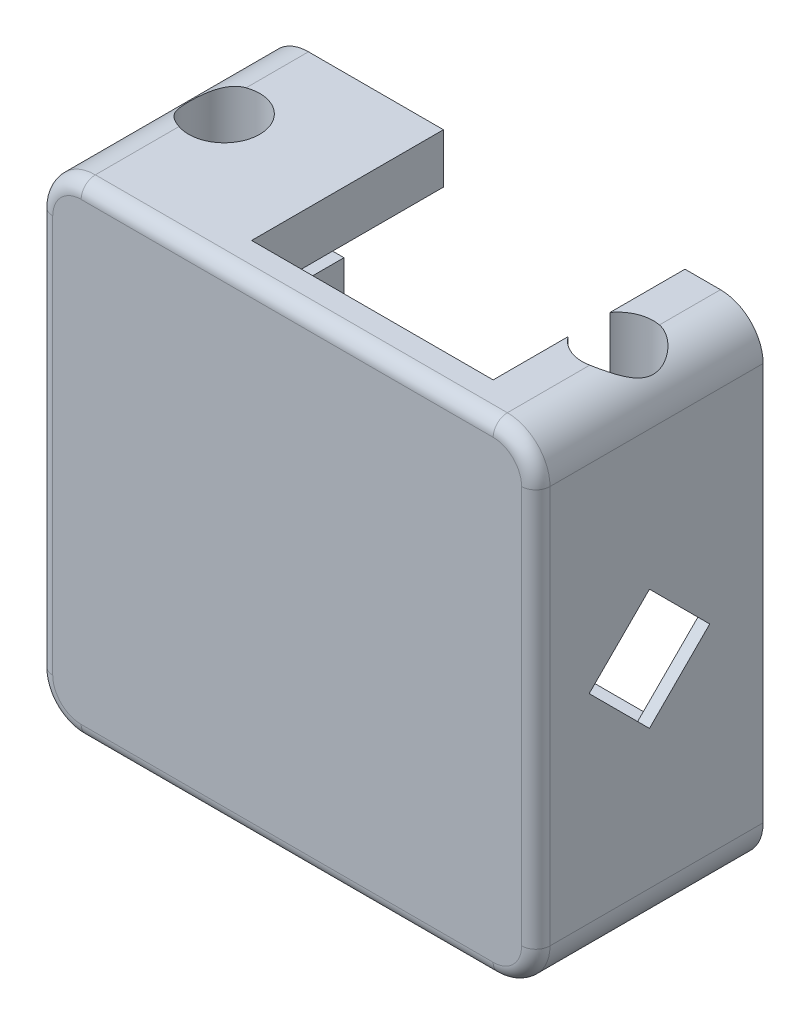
ISO-10303-21;
HEADER;
FILE_DESCRIPTION(('STEP AP214'),'2;1');
FILE_NAME('part.step','',(''),(''),'','','');
FILE_SCHEMA(('AUTOMOTIVE_DESIGN { 1 0 10303 214 1 1 1 1 }'));
ENDSEC;
DATA;
#1=APPLICATION_CONTEXT('core data for automotive mechanical design processes');
#2=APPLICATION_PROTOCOL_DEFINITION('international standard','automotive_design',2000,#1);
#3=PRODUCT_CONTEXT('',#1,'mechanical');
#4=PRODUCT('Part','Part','',(#3));
#5=PRODUCT_RELATED_PRODUCT_CATEGORY('part','',(#4));
#6=PRODUCT_DEFINITION_FORMATION('','',#4);
#7=PRODUCT_DEFINITION_CONTEXT('part definition',#1,'design');
#8=PRODUCT_DEFINITION('design','',#6,#7);
#9=PRODUCT_DEFINITION_SHAPE('','',#8);
#10=(LENGTH_UNIT() NAMED_UNIT(*) SI_UNIT(.MILLI.,.METRE.));
#11=(NAMED_UNIT(*) PLANE_ANGLE_UNIT() SI_UNIT($,.RADIAN.));
#12=(NAMED_UNIT(*) SI_UNIT($,.STERADIAN.) SOLID_ANGLE_UNIT());
#13=UNCERTAINTY_MEASURE_WITH_UNIT(LENGTH_MEASURE(1.E-05),#10,'distance_accuracy_value','');
#14=(GEOMETRIC_REPRESENTATION_CONTEXT(3) GLOBAL_UNCERTAINTY_ASSIGNED_CONTEXT((#13)) GLOBAL_UNIT_ASSIGNED_CONTEXT((#10,
#11,#12)) REPRESENTATION_CONTEXT('',''));
#15=CARTESIAN_POINT('',(0.,0.,0.));
#16=DIRECTION('',(0.,0.,1.));
#17=DIRECTION('',(1.,0.,0.));
#18=AXIS2_PLACEMENT_3D('',#15,#16,#17);
#19=CARTESIAN_POINT('',(12.,13.2,-65.6446577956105));
#20=DIRECTION('',(0.,-1.,0.));
#21=DIRECTION('',(0.,0.,-1.));
#22=AXIS2_PLACEMENT_3D('',#19,#20,#21);
#23=PLANE('',#22);
#24=DIRECTION('',(-1.,0.,0.));
#25=VECTOR('',#24,1.);
#26=CARTESIAN_POINT('',(-17.501,13.2,-17.3284324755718));
#27=LINE('',#26,#25);
#28=CARTESIAN_POINT('',(13.1924428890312,13.2,-17.3284324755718));
#29=VERTEX_POINT('',#28);
#30=CARTESIAN_POINT('',(12.,13.2,-17.3284324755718));
#31=VERTEX_POINT('',#30);
#32=EDGE_CURVE('E64',#29,#31,#27,.T.);
#33=ORIENTED_EDGE('',*,*,#32,.T.);
#34=DIRECTION('',(0.,0.,1.));
#35=VECTOR('',#34,1.);
#36=CARTESIAN_POINT('',(12.,13.2,-65.6446577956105));
#37=LINE('',#36,#35);
#38=CARTESIAN_POINT('',(12.,13.2,-24.2857917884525));
#39=VERTEX_POINT('',#38);
#40=EDGE_CURVE('E378',#39,#31,#37,.T.);
#41=ORIENTED_EDGE('',*,*,#40,.F.);
#42=DIRECTION('',(-1.,0.,0.));
#43=VECTOR('',#42,1.);
#44=CARTESIAN_POINT('',(12.,13.2,-24.2857917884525));
#45=LINE('',#44,#43);
#46=CARTESIAN_POINT('',(16.6667620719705,13.2,-24.2857917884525));
#47=VERTEX_POINT('',#46);
#48=EDGE_CURVE('E374',#47,#39,#45,.T.);
#49=ORIENTED_EDGE('',*,*,#48,.F.);
#50=DIRECTION('',(0.,0.,1.));
#51=VECTOR('',#50,1.);
#52=CARTESIAN_POINT('',(16.6667620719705,13.2,-65.6446577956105));
#53=LINE('',#52,#51);
#54=CARTESIAN_POINT('',(16.6667620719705,13.2,-17.3284324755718));
#55=VERTEX_POINT('',#54);
#56=EDGE_CURVE('E366',#47,#55,#53,.T.);
#57=ORIENTED_EDGE('',*,*,#56,.T.);
#58=CARTESIAN_POINT('',(14.8410812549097,13.2,-17.3284324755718));
#59=VERTEX_POINT('',#58);
#60=EDGE_CURVE('E350',#55,#59,#27,.T.);
#61=ORIENTED_EDGE('',*,*,#60,.T.);
#62=CARTESIAN_POINT('',(14.0167620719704,13.2,-17.5357917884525));
#63=DIRECTION('',(0.,-1.,0.));
#64=DIRECTION('',(0.,0.,-1.));
#65=AXIS2_PLACEMENT_3D('',#62,#63,#64);
#66=CIRCLE('',#65,0.85);
#67=EDGE_CURVE('E1474',#29,#59,#66,.T.);
#68=ORIENTED_EDGE('',*,*,#67,.F.);
#69=EDGE_LOOP('',(#33,#41,#49,#57,#61,#68));
#70=FACE_BOUND('',#69,.T.);
#71=ADVANCED_FACE('F41',(#70),#23,.T.);
#72=CARTESIAN_POINT('',(-17.5,27.,-24.2857917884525));
#73=DIRECTION('',(0.,1.,0.));
#74=DIRECTION('',(0.,0.,1.));
#75=AXIS2_PLACEMENT_3D('',#72,#73,#74);
#76=PLANE('',#75);
#77=CARTESIAN_POINT('',(14.0167620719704,27.,-17.5357917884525));
#78=DIRECTION('',(0.,1.,0.));
#79=DIRECTION('',(0.,0.,1.));
#80=AXIS2_PLACEMENT_3D('',#77,#78,#79);
#81=CIRCLE('',#80,2.5);
#82=CARTESIAN_POINT('',(14.5,27.,-19.9886434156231));
#83=VERTEX_POINT('',#82);
#84=CARTESIAN_POINT('',(12.,27.,-19.0131782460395));
#85=VERTEX_POINT('',#84);
#86=EDGE_CURVE('E738',#83,#85,#81,.T.);
#87=ORIENTED_EDGE('',*,*,#86,.F.);
#88=DIRECTION('',(0.,0.,1.));
#89=VECTOR('',#88,1.);
#90=CARTESIAN_POINT('',(14.5,27.,-24.2857917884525));
#91=LINE('',#90,#89);
#92=CARTESIAN_POINT('',(14.5,27.,-24.2857917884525));
#93=VERTEX_POINT('',#92);
#94=EDGE_CURVE('E485',#83,#93,#91,.F.);
#95=ORIENTED_EDGE('',*,*,#94,.T.);
#96=DIRECTION('',(-1.,0.,0.));
#97=VECTOR('',#96,1.);
#98=CARTESIAN_POINT('',(-17.5,27.,-24.2857917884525));
#99=LINE('',#98,#97);
#100=CARTESIAN_POINT('',(12.,27.,-24.2857917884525));
#101=VERTEX_POINT('',#100);
#102=EDGE_CURVE('E430',#93,#101,#99,.T.);
#103=ORIENTED_EDGE('',*,*,#102,.T.);
#104=DIRECTION('',(0.,0.,-1.));
#105=VECTOR('',#104,1.);
#106=CARTESIAN_POINT('',(12.,27.,-24.2857917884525));
#107=LINE('',#106,#105);
#108=EDGE_CURVE('E407',#85,#101,#107,.T.);
#109=ORIENTED_EDGE('',*,*,#108,.F.);
#110=EDGE_LOOP('',(#87,#95,#103,#109));
#111=FACE_BOUND('',#110,.T.);
#112=ADVANCED_FACE('F673',(#111),#76,.T.);
#113=CARTESIAN_POINT('',(0.,0.,-24.2857917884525));
#114=DIRECTION('',(0.,0.,1.));
#115=DIRECTION('',(1.,0.,0.));
#116=AXIS2_PLACEMENT_3D('',#113,#114,#115);
#117=PLANE('',#116);
#118=DIRECTION('',(-1.,0.,0.));
#119=VECTOR('',#118,1.);
#120=CARTESIAN_POINT('',(14.6667620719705,-4.92054771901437,-24.2857917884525));
#121=LINE('',#120,#119);
#122=CARTESIAN_POINT('',(16.6667620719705,-4.92054771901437,-24.2857917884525));
#123=VERTEX_POINT('',#122);
#124=CARTESIAN_POINT('',(-17.3552743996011,-4.92054771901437,-24.2857917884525));
#125=VERTEX_POINT('',#124);
#126=EDGE_CURVE('E779',#123,#125,#121,.T.);
#127=ORIENTED_EDGE('',*,*,#126,.F.);
#128=DIRECTION('',(0.,1.,0.));
#129=VECTOR('',#128,1.);
#130=CARTESIAN_POINT('',(16.6667620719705,13.2,-24.2857917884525));
#131=LINE('',#130,#129);
#132=EDGE_CURVE('E780',#123,#47,#131,.T.);
#133=ORIENTED_EDGE('',*,*,#132,.T.);
#134=ORIENTED_EDGE('',*,*,#48,.T.);
#135=DIRECTION('',(0.,1.,0.));
#136=VECTOR('',#135,1.);
#137=CARTESIAN_POINT('',(12.,15.7,-24.2857917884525));
#138=LINE('',#137,#136);
#139=CARTESIAN_POINT('',(12.,15.7,-24.2857917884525));
#140=VERTEX_POINT('',#139);
#141=EDGE_CURVE('E835',#39,#140,#138,.T.);
#142=ORIENTED_EDGE('',*,*,#141,.T.);
#143=DIRECTION('',(1.,0.,0.));
#144=VECTOR('',#143,1.);
#145=CARTESIAN_POINT('',(16.6667620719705,15.7,-24.2857917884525));
#146=LINE('',#145,#144);
#147=CARTESIAN_POINT('',(16.6667620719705,15.7,-24.2857917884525));
#148=VERTEX_POINT('',#147);
#149=EDGE_CURVE('E838',#140,#148,#146,.T.);
#150=ORIENTED_EDGE('',*,*,#149,.T.);
#151=DIRECTION('',(0.,1.,0.));
#152=VECTOR('',#151,1.);
#153=CARTESIAN_POINT('',(16.6667620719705,18.5,-24.2857917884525));
#154=LINE('',#153,#152);
#155=CARTESIAN_POINT('',(16.6667620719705,18.5,-24.2857917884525));
#156=VERTEX_POINT('',#155);
#157=EDGE_CURVE('E841',#148,#156,#154,.T.);
#158=ORIENTED_EDGE('',*,*,#157,.T.);
#159=DIRECTION('',(-1.,0.,0.));
#160=VECTOR('',#159,1.);
#161=CARTESIAN_POINT('',(16.6667620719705,18.5,-24.2857917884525));
#162=LINE('',#161,#160);
#163=CARTESIAN_POINT('',(12.,18.5,-24.2857917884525));
#164=VERTEX_POINT('',#163);
#165=EDGE_CURVE('E401',#156,#164,#162,.T.);
#166=ORIENTED_EDGE('',*,*,#165,.T.);
#167=DIRECTION('',(0.,1.,0.));
#168=VECTOR('',#167,1.);
#169=CARTESIAN_POINT('',(12.,22.,-24.2857917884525));
#170=LINE('',#169,#168);
#171=EDGE_CURVE('E415',#164,#101,#170,.T.);
#172=ORIENTED_EDGE('',*,*,#171,.T.);
#173=ORIENTED_EDGE('',*,*,#102,.F.);
#174=CARTESIAN_POINT('',(14.5,24.,-24.2857917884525));
#175=DIRECTION('',(0.,0.,1.));
#176=DIRECTION('',(1.,0.,0.));
#177=AXIS2_PLACEMENT_3D('',#174,#175,#176);
#178=CIRCLE('',#177,3.);
#179=CARTESIAN_POINT('',(17.5,24.,-24.2857917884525));
#180=VERTEX_POINT('',#179);
#181=EDGE_CURVE('E502',#93,#180,#178,.F.);
#182=ORIENTED_EDGE('',*,*,#181,.T.);
#183=DIRECTION('',(0.,1.,0.));
#184=VECTOR('',#183,1.);
#185=CARTESIAN_POINT('',(17.5,27.,-24.2857917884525));
#186=LINE('',#185,#184);
#187=CARTESIAN_POINT('',(17.5,-4.00000000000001,-24.2857917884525));
#188=VERTEX_POINT('',#187);
#189=EDGE_CURVE('E426',#188,#180,#186,.T.);
#190=ORIENTED_EDGE('',*,*,#189,.F.);
#191=CARTESIAN_POINT('',(14.5,-4.00000000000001,-24.2857917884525));
#192=DIRECTION('',(0.,0.,1.));
#193=DIRECTION('',(1.,0.,0.));
#194=AXIS2_PLACEMENT_3D('',#191,#192,#193);
#195=CIRCLE('',#194,3.);
#196=CARTESIAN_POINT('',(14.5,-7.00000000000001,-24.2857917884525));
#197=VERTEX_POINT('',#196);
#198=EDGE_CURVE('E497',#188,#197,#195,.F.);
#199=ORIENTED_EDGE('',*,*,#198,.T.);
#200=DIRECTION('',(1.,0.,0.));
#201=VECTOR('',#200,1.);
#202=CARTESIAN_POINT('',(-17.5,-7.00000000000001,-24.2857917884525));
#203=LINE('',#202,#201);
#204=CARTESIAN_POINT('',(-14.5,-7.00000000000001,-24.2857917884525));
#205=VERTEX_POINT('',#204);
#206=EDGE_CURVE('E423',#205,#197,#203,.T.);
#207=ORIENTED_EDGE('',*,*,#206,.F.);
#208=CARTESIAN_POINT('',(-14.5,-4.00000000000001,-24.2857917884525));
#209=DIRECTION('',(0.,0.,1.));
#210=DIRECTION('',(1.,0.,0.));
#211=AXIS2_PLACEMENT_3D('',#208,#209,#210);
#212=CIRCLE('',#211,3.);
#213=EDGE_CURVE('E499',#205,#125,#212,.F.);
#214=ORIENTED_EDGE('',*,*,#213,.T.);
#215=EDGE_LOOP('',(#127,#133,#134,#142,#150,#158,#166,#172,#173,#182,#190,#199,#207,#214));
#216=FACE_BOUND('',#215,.T.);
#217=ADVANCED_FACE('F664',(#216),#117,.F.);
#218=CARTESIAN_POINT('',(0.,0.,-8.2857917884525));
#219=DIRECTION('',(0.,0.,1.));
#220=DIRECTION('',(1.,0.,0.));
#221=AXIS2_PLACEMENT_3D('',#218,#219,#220);
#222=PLANE('',#221);
#223=CARTESIAN_POINT('',(14.5,-4.00000000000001,-8.2857917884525));
#224=DIRECTION('',(0.,0.,1.));
#225=DIRECTION('',(1.,0.,0.));
#226=AXIS2_PLACEMENT_3D('',#223,#224,#225);
#227=CIRCLE('',#226,2.);
#228=CARTESIAN_POINT('',(16.5,-4.00000000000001,-8.2857917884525));
#229=VERTEX_POINT('',#228);
#230=CARTESIAN_POINT('',(14.5,-6.00000000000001,-8.2857917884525));
#231=VERTEX_POINT('',#230);
#232=EDGE_CURVE('E470',#229,#231,#227,.F.);
#233=ORIENTED_EDGE('',*,*,#232,.F.);
#234=DIRECTION('',(0.,1.,0.));
#235=VECTOR('',#234,1.);
#236=CARTESIAN_POINT('',(16.5,0.,-8.2857917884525));
#237=LINE('',#236,#235);
#238=CARTESIAN_POINT('',(16.5,24.,-8.2857917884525));
#239=VERTEX_POINT('',#238);
#240=EDGE_CURVE('E442',#229,#239,#237,.T.);
#241=ORIENTED_EDGE('',*,*,#240,.T.);
#242=CARTESIAN_POINT('',(14.5,24.,-8.2857917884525));
#243=DIRECTION('',(0.,0.,1.));
#244=DIRECTION('',(1.,0.,0.));
#245=AXIS2_PLACEMENT_3D('',#242,#243,#244);
#246=CIRCLE('',#245,2.);
#247=CARTESIAN_POINT('',(14.5,26.,-8.2857917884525));
#248=VERTEX_POINT('',#247);
#249=EDGE_CURVE('E465',#248,#239,#246,.F.);
#250=ORIENTED_EDGE('',*,*,#249,.F.);
#251=DIRECTION('',(-1.,0.,0.));
#252=VECTOR('',#251,1.);
#253=CARTESIAN_POINT('',(0.,26.,-8.2857917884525));
#254=LINE('',#253,#252);
#255=CARTESIAN_POINT('',(-14.5,26.,-8.2857917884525));
#256=VERTEX_POINT('',#255);
#257=EDGE_CURVE('E433',#248,#256,#254,.T.);
#258=ORIENTED_EDGE('',*,*,#257,.T.);
#259=CARTESIAN_POINT('',(-14.5,24.,-8.2857917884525));
#260=DIRECTION('',(0.,0.,1.));
#261=DIRECTION('',(1.,0.,0.));
#262=AXIS2_PLACEMENT_3D('',#259,#260,#261);
#263=CIRCLE('',#262,2.);
#264=CARTESIAN_POINT('',(-16.5,24.,-8.2857917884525));
#265=VERTEX_POINT('',#264);
#266=EDGE_CURVE('E462',#265,#256,#263,.F.);
#267=ORIENTED_EDGE('',*,*,#266,.F.);
#268=DIRECTION('',(0.,-1.,0.));
#269=VECTOR('',#268,1.);
#270=CARTESIAN_POINT('',(-16.5,0.,-8.2857917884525));
#271=LINE('',#270,#269);
#272=CARTESIAN_POINT('',(-16.5,-4.00000000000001,-8.2857917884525));
#273=VERTEX_POINT('',#272);
#274=EDGE_CURVE('E436',#265,#273,#271,.T.);
#275=ORIENTED_EDGE('',*,*,#274,.T.);
#276=CARTESIAN_POINT('',(-14.5,-4.00000000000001,-8.2857917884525));
#277=DIRECTION('',(0.,0.,1.));
#278=DIRECTION('',(1.,0.,0.));
#279=AXIS2_PLACEMENT_3D('',#276,#277,#278);
#280=CIRCLE('',#279,2.);
#281=CARTESIAN_POINT('',(-14.5,-6.00000000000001,-8.2857917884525));
#282=VERTEX_POINT('',#281);
#283=EDGE_CURVE('E468',#282,#273,#280,.F.);
#284=ORIENTED_EDGE('',*,*,#283,.F.);
#285=DIRECTION('',(1.,0.,0.));
#286=VECTOR('',#285,1.);
#287=CARTESIAN_POINT('',(0.,-6.00000000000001,-8.2857917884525));
#288=LINE('',#287,#286);
#289=EDGE_CURVE('E439',#282,#231,#288,.T.);
#290=ORIENTED_EDGE('',*,*,#289,.T.);
#291=EDGE_LOOP('',(#233,#241,#250,#258,#267,#275,#284,#290));
#292=FACE_BOUND('',#291,.T.);
#293=ADVANCED_FACE('F662',(#292),#222,.T.);
#294=DIRECTION('',(1.,0.,0.));
#295=VECTOR('',#294,1.);
#296=CARTESIAN_POINT('',(12.,-1.43102078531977,-24.2857917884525));
#297=LINE('',#296,#295);
#298=CARTESIAN_POINT('',(-12.,-1.43102078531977,-24.2857917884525));
#299=VERTEX_POINT('',#298);
#300=CARTESIAN_POINT('',(12.,-1.43102078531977,-24.2857917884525));
#301=VERTEX_POINT('',#300);
#302=EDGE_CURVE('E830',#299,#301,#297,.T.);
#303=ORIENTED_EDGE('',*,*,#302,.T.);
#304=DIRECTION('',(0.,1.,0.));
#305=VECTOR('',#304,1.);
#306=CARTESIAN_POINT('',(12.,-1.43102078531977,-24.2857917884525));
#307=LINE('',#306,#305);
#308=CARTESIAN_POINT('',(12.,-2.92054771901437,-24.2857917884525));
#309=VERTEX_POINT('',#308);
#310=EDGE_CURVE('E784',#309,#301,#307,.T.);
#311=ORIENTED_EDGE('',*,*,#310,.F.);
#312=DIRECTION('',(1.,0.,0.));
#313=VECTOR('',#312,1.);
#314=CARTESIAN_POINT('',(12.,-2.92054771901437,-24.2857917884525));
#315=LINE('',#314,#313);
#316=CARTESIAN_POINT('',(-17.5,-2.92054771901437,-24.2857917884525));
#317=VERTEX_POINT('',#316);
#318=EDGE_CURVE('E789',#317,#309,#315,.T.);
#319=ORIENTED_EDGE('',*,*,#318,.F.);
#320=DIRECTION('',(0.,-1.,0.));
#321=VECTOR('',#320,1.);
#322=CARTESIAN_POINT('',(-17.5,27.,-24.2857917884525));
#323=LINE('',#322,#321);
#324=CARTESIAN_POINT('',(-17.5,24.,-24.2857917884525));
#325=VERTEX_POINT('',#324);
#326=EDGE_CURVE('E414',#325,#317,#323,.T.);
#327=ORIENTED_EDGE('',*,*,#326,.F.);
#328=CARTESIAN_POINT('',(-14.5,24.,-24.2857917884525));
#329=DIRECTION('',(0.,0.,1.));
#330=DIRECTION('',(1.,0.,0.));
#331=AXIS2_PLACEMENT_3D('',#328,#329,#330);
#332=CIRCLE('',#331,3.);
#333=CARTESIAN_POINT('',(-14.5,27.,-24.2857917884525));
#334=VERTEX_POINT('',#333);
#335=EDGE_CURVE('E504',#325,#334,#332,.F.);
#336=ORIENTED_EDGE('',*,*,#335,.T.);
#337=CARTESIAN_POINT('',(-5.,27.,-24.2857917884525));
#338=VERTEX_POINT('',#337);
#339=EDGE_CURVE('E429',#338,#334,#99,.T.);
#340=ORIENTED_EDGE('',*,*,#339,.F.);
#341=DIRECTION('',(0.,1.,0.));
#342=VECTOR('',#341,1.);
#343=CARTESIAN_POINT('',(-5.,22.,-24.2857917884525));
#344=LINE('',#343,#342);
#345=CARTESIAN_POINT('',(-5.,23.5,-24.2857917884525));
#346=VERTEX_POINT('',#345);
#347=EDGE_CURVE('E412',#346,#338,#344,.T.);
#348=ORIENTED_EDGE('',*,*,#347,.F.);
#349=DIRECTION('',(-1.,0.,0.));
#350=VECTOR('',#349,1.);
#351=CARTESIAN_POINT('',(12.,23.5,-24.2857917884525));
#352=LINE('',#351,#350);
#353=CARTESIAN_POINT('',(-12.,23.5,-24.2857917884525));
#354=VERTEX_POINT('',#353);
#355=EDGE_CURVE('E394',#346,#354,#352,.T.);
#356=ORIENTED_EDGE('',*,*,#355,.T.);
#357=DIRECTION('',(0.,-1.,0.));
#358=VECTOR('',#357,1.);
#359=CARTESIAN_POINT('',(-12.,23.5,-24.2857917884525));
#360=LINE('',#359,#358);
#361=CARTESIAN_POINT('',(-12.,18.5,-24.2857917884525));
#362=VERTEX_POINT('',#361);
#363=EDGE_CURVE('E397',#354,#362,#360,.T.);
#364=ORIENTED_EDGE('',*,*,#363,.T.);
#365=DIRECTION('',(-1.,0.,0.));
#366=VECTOR('',#365,1.);
#367=CARTESIAN_POINT('',(-12.,18.5,-24.2857917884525));
#368=LINE('',#367,#366);
#369=CARTESIAN_POINT('',(-16.3332379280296,18.5,-24.2857917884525));
#370=VERTEX_POINT('',#369);
#371=EDGE_CURVE('E806',#362,#370,#368,.T.);
#372=ORIENTED_EDGE('',*,*,#371,.T.);
#373=DIRECTION('',(0.,-1.,0.));
#374=VECTOR('',#373,1.);
#375=CARTESIAN_POINT('',(-16.3332379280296,18.5,-24.2857917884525));
#376=LINE('',#375,#374);
#377=CARTESIAN_POINT('',(-16.3332379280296,15.7,-24.2857917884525));
#378=VERTEX_POINT('',#377);
#379=EDGE_CURVE('E809',#370,#378,#376,.T.);
#380=ORIENTED_EDGE('',*,*,#379,.T.);
#381=DIRECTION('',(1.,0.,0.));
#382=VECTOR('',#381,1.);
#383=CARTESIAN_POINT('',(-16.3332379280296,15.7,-24.2857917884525));
#384=LINE('',#383,#382);
#385=CARTESIAN_POINT('',(-12.,15.7,-24.2857917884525));
#386=VERTEX_POINT('',#385);
#387=EDGE_CURVE('E812',#378,#386,#384,.T.);
#388=ORIENTED_EDGE('',*,*,#387,.T.);
#389=DIRECTION('',(0.,-1.,0.));
#390=VECTOR('',#389,1.);
#391=CARTESIAN_POINT('',(-12.,15.7,-24.2857917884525));
#392=LINE('',#391,#390);
#393=CARTESIAN_POINT('',(-12.,13.2,-24.2857917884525));
#394=VERTEX_POINT('',#393);
#395=EDGE_CURVE('E815',#386,#394,#392,.T.);
#396=ORIENTED_EDGE('',*,*,#395,.T.);
#397=DIRECTION('',(-1.,0.,0.));
#398=VECTOR('',#397,1.);
#399=CARTESIAN_POINT('',(-12.,13.2,-24.2857917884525));
#400=LINE('',#399,#398);
#401=CARTESIAN_POINT('',(-16.3332379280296,13.2,-24.2857917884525));
#402=VERTEX_POINT('',#401);
#403=EDGE_CURVE('E818',#394,#402,#400,.T.);
#404=ORIENTED_EDGE('',*,*,#403,.T.);
#405=DIRECTION('',(0.,-1.,0.));
#406=VECTOR('',#405,1.);
#407=CARTESIAN_POINT('',(-16.3332379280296,13.2,-24.2857917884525));
#408=LINE('',#407,#406);
#409=CARTESIAN_POINT('',(-16.3332379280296,4.5,-24.2857917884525));
#410=VERTEX_POINT('',#409);
#411=EDGE_CURVE('E821',#402,#410,#408,.T.);
#412=ORIENTED_EDGE('',*,*,#411,.T.);
#413=DIRECTION('',(1.,0.,0.));
#414=VECTOR('',#413,1.);
#415=CARTESIAN_POINT('',(-12.,4.5,-24.2857917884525));
#416=LINE('',#415,#414);
#417=CARTESIAN_POINT('',(-12.,4.5,-24.2857917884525));
#418=VERTEX_POINT('',#417);
#419=EDGE_CURVE('E824',#410,#418,#416,.T.);
#420=ORIENTED_EDGE('',*,*,#419,.T.);
#421=DIRECTION('',(0.,-1.,0.));
#422=VECTOR('',#421,1.);
#423=CARTESIAN_POINT('',(-12.,4.5,-24.2857917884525));
#424=LINE('',#423,#422);
#425=EDGE_CURVE('E827',#418,#299,#424,.T.);
#426=ORIENTED_EDGE('',*,*,#425,.T.);
#427=EDGE_LOOP('',(#303,#311,#319,#327,#336,#340,#348,#356,#364,#372,#380,#388,#396,#404,#412,
#420,#426));
#428=FACE_BOUND('',#427,.T.);
#429=ADVANCED_FACE('F658',(#428),#117,.F.);
#430=CARTESIAN_POINT('',(-5.,22.,-24.2857917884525));
#431=DIRECTION('',(-1.,0.,0.));
#432=DIRECTION('',(0.,0.,1.));
#433=AXIS2_PLACEMENT_3D('',#430,#431,#432);
#434=PLANE('',#433);
#435=DIRECTION('',(0.,0.,1.));
#436=VECTOR('',#435,1.);
#437=CARTESIAN_POINT('',(-5.,23.5,-24.2857917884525));
#438=LINE('',#437,#436);
#439=CARTESIAN_POINT('',(-4.99999999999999,23.5,-10.7857917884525));
#440=VERTEX_POINT('',#439);
#441=EDGE_CURVE('E398',#346,#440,#438,.T.);
#442=ORIENTED_EDGE('',*,*,#441,.F.);
#443=ORIENTED_EDGE('',*,*,#347,.T.);
#444=DIRECTION('',(0.,0.,1.));
#445=VECTOR('',#444,1.);
#446=CARTESIAN_POINT('',(-5.,27.,-24.2857917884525));
#447=LINE('',#446,#445);
#448=CARTESIAN_POINT('',(-5.,27.,-10.7857917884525));
#449=VERTEX_POINT('',#448);
#450=EDGE_CURVE('E400',#338,#449,#447,.T.);
#451=ORIENTED_EDGE('',*,*,#450,.T.);
#452=DIRECTION('',(0.,1.,0.));
#453=VECTOR('',#452,1.);
#454=CARTESIAN_POINT('',(-5.,22.,-10.7857917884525));
#455=LINE('',#454,#453);
#456=EDGE_CURVE('E411',#440,#449,#455,.T.);
#457=ORIENTED_EDGE('',*,*,#456,.F.);
#458=EDGE_LOOP('',(#442,#443,#451,#457));
#459=FACE_BOUND('',#458,.T.);
#460=ADVANCED_FACE('F654',(#459),#434,.F.);
#461=CARTESIAN_POINT('',(-17.5,27.,-24.2857917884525));
#462=DIRECTION('',(-1.,0.,0.));
#463=DIRECTION('',(0.,-1.,0.));
#464=AXIS2_PLACEMENT_3D('',#461,#462,#463);
#465=PLANE('',#464);
#466=CARTESIAN_POINT('',(-17.5,9.99999999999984,-16.2857917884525));
#467=DIRECTION('',(-1.,0.,0.));
#468=DIRECTION('',(0.,-1.,0.));
#469=AXIS2_PLACEMENT_3D('',#466,#467,#468);
#470=CIRCLE('',#469,2.5);
#471=CARTESIAN_POINT('',(-17.5,7.49999999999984,-16.2857917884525));
#472=VERTEX_POINT('',#471);
#473=EDGE_CURVE('E1425',#472,#472,#470,.T.);
#474=ORIENTED_EDGE('',*,*,#473,.F.);
#475=EDGE_LOOP('',(#474));
#476=FACE_BOUND('',#475,.T.);
#477=DIRECTION('',(0.,1.,0.));
#478=VECTOR('',#477,1.);
#479=CARTESIAN_POINT('',(-17.5,27.,-10.7857917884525));
#480=LINE('',#479,#478);
#481=CARTESIAN_POINT('',(-17.5,-4.00000000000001,-10.7857917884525));
#482=VERTEX_POINT('',#481);
#483=CARTESIAN_POINT('',(-17.5,-2.92054771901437,-10.7857917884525));
#484=VERTEX_POINT('',#483);
#485=EDGE_CURVE('E528',#482,#484,#480,.T.);
#486=ORIENTED_EDGE('',*,*,#485,.F.);
#487=DIRECTION('',(0.,0.,1.));
#488=VECTOR('',#487,1.);
#489=CARTESIAN_POINT('',(-17.5,-4.00000000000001,-24.2857917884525));
#490=LINE('',#489,#488);
#491=CARTESIAN_POINT('',(-17.5,-4.00000000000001,-9.2857917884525));
#492=VERTEX_POINT('',#491);
#493=EDGE_CURVE('E493',#482,#492,#490,.T.);
#494=ORIENTED_EDGE('',*,*,#493,.T.);
#495=DIRECTION('',(0.,-1.,0.));
#496=VECTOR('',#495,1.);
#497=CARTESIAN_POINT('',(-17.5,27.,-9.2857917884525));
#498=LINE('',#497,#496);
#499=CARTESIAN_POINT('',(-17.5,24.,-9.2857917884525));
#500=VERTEX_POINT('',#499);
#501=EDGE_CURVE('E451',#492,#500,#498,.F.);
#502=ORIENTED_EDGE('',*,*,#501,.T.);
#503=DIRECTION('',(0.,0.,1.));
#504=VECTOR('',#503,1.);
#505=CARTESIAN_POINT('',(-17.5,24.,-24.2857917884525));
#506=LINE('',#505,#504);
#507=EDGE_CURVE('E495',#500,#325,#506,.F.);
#508=ORIENTED_EDGE('',*,*,#507,.T.);
#509=ORIENTED_EDGE('',*,*,#326,.T.);
#510=DIRECTION('',(0.,0.,-1.));
#511=VECTOR('',#510,1.);
#512=CARTESIAN_POINT('',(-17.5,-2.92054771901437,-24.2857917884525));
#513=LINE('',#512,#511);
#514=EDGE_CURVE('E532',#484,#317,#513,.T.);
#515=ORIENTED_EDGE('',*,*,#514,.F.);
#516=EDGE_LOOP('',(#486,#494,#502,#508,#509,#515));
#517=FACE_BOUND('',#516,.T.);
#518=ADVANCED_FACE('F657',(#476,#517),#465,.T.);
#519=CARTESIAN_POINT('',(12.,27.,-16.0584053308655));
#520=VERTEX_POINT('',#519);
#521=CARTESIAN_POINT('',(14.5,27.,-15.0829401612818));
#522=VERTEX_POINT('',#521);
#523=EDGE_CURVE('E744',#520,#522,#81,.T.);
#524=ORIENTED_EDGE('',*,*,#523,.F.);
#525=CARTESIAN_POINT('',(12.,27.,-10.7857917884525));
#526=VERTEX_POINT('',#525);
#527=EDGE_CURVE('E408',#526,#520,#107,.T.);
#528=ORIENTED_EDGE('',*,*,#527,.F.);
#529=DIRECTION('',(1.,0.,0.));
#530=VECTOR('',#529,1.);
#531=CARTESIAN_POINT('',(-5.,27.,-10.7857917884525));
#532=LINE('',#531,#530);
#533=EDGE_CURVE('E404',#449,#526,#532,.T.);
#534=ORIENTED_EDGE('',*,*,#533,.F.);
#535=ORIENTED_EDGE('',*,*,#450,.F.);
#536=ORIENTED_EDGE('',*,*,#339,.T.);
#537=DIRECTION('',(0.,0.,1.));
#538=VECTOR('',#537,1.);
#539=CARTESIAN_POINT('',(-14.5,27.,-24.2857917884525));
#540=LINE('',#539,#538);
#541=CARTESIAN_POINT('',(-14.5,27.,-19.8986078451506));
#542=VERTEX_POINT('',#541);
#543=EDGE_CURVE('E490',#334,#542,#540,.T.);
#544=ORIENTED_EDGE('',*,*,#543,.T.);
#545=CARTESIAN_POINT('',(-13.6832379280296,27.,-17.5357917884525));
#546=DIRECTION('',(0.,1.,0.));
#547=DIRECTION('',(0.,0.,1.));
#548=AXIS2_PLACEMENT_3D('',#545,#546,#547);
#549=CIRCLE('',#548,2.5);
#550=CARTESIAN_POINT('',(-14.5,27.,-15.1729757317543));
#551=VERTEX_POINT('',#550);
#552=EDGE_CURVE('E938',#551,#542,#549,.T.);
#553=ORIENTED_EDGE('',*,*,#552,.F.);
#554=CARTESIAN_POINT('',(-14.5,27.,-9.2857917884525));
#555=VERTEX_POINT('',#554);
#556=EDGE_CURVE('E489',#551,#555,#540,.T.);
#557=ORIENTED_EDGE('',*,*,#556,.T.);
#558=DIRECTION('',(-1.,0.,0.));
#559=VECTOR('',#558,1.);
#560=CARTESIAN_POINT('',(-17.5,27.,-9.2857917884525));
#561=LINE('',#560,#559);
#562=CARTESIAN_POINT('',(14.5,27.,-9.2857917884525));
#563=VERTEX_POINT('',#562);
#564=EDGE_CURVE('E454',#555,#563,#561,.F.);
#565=ORIENTED_EDGE('',*,*,#564,.T.);
#566=EDGE_CURVE('E486',#563,#522,#91,.F.);
#567=ORIENTED_EDGE('',*,*,#566,.T.);
#568=EDGE_LOOP('',(#524,#528,#534,#535,#536,#544,#553,#557,#565,#567));
#569=FACE_BOUND('',#568,.T.);
#570=ADVANCED_FACE('F668',(#569),#76,.T.);
#571=CARTESIAN_POINT('',(17.5,27.,-24.2857917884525));
#572=DIRECTION('',(1.,0.,0.));
#573=DIRECTION('',(0.,1.,0.));
#574=AXIS2_PLACEMENT_3D('',#571,#572,#573);
#575=PLANE('',#574);
#576=DIRECTION('',(0.,-0.707106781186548,-0.707106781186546));
#577=VECTOR('',#576,1.);
#578=CARTESIAN_POINT('',(17.5,9.99999999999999,-12.0431511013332));
#579=LINE('',#578,#577);
#580=CARTESIAN_POINT('',(17.5,9.99999999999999,-12.0431511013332));
#581=VERTEX_POINT('',#580);
#582=CARTESIAN_POINT('',(17.5,5.7573593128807,-16.2857917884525));
#583=VERTEX_POINT('',#582);
#584=EDGE_CURVE('E1442',#581,#583,#579,.T.);
#585=ORIENTED_EDGE('',*,*,#584,.F.);
#586=DIRECTION('',(0.,-0.707106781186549,0.707106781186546));
#587=VECTOR('',#586,1.);
#588=CARTESIAN_POINT('',(17.5,9.99999999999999,-12.0431511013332));
#589=LINE('',#588,#587);
#590=CARTESIAN_POINT('',(17.5,14.2426406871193,-16.2857917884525));
#591=VERTEX_POINT('',#590);
#592=EDGE_CURVE('E1439',#591,#581,#589,.T.);
#593=ORIENTED_EDGE('',*,*,#592,.F.);
#594=DIRECTION('',(0.,0.707106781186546,0.707106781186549));
#595=VECTOR('',#594,1.);
#596=CARTESIAN_POINT('',(17.5,9.99999999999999,-20.5284324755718));
#597=LINE('',#596,#595);
#598=CARTESIAN_POINT('',(17.5,9.99999999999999,-20.5284324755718));
#599=VERTEX_POINT('',#598);
#600=EDGE_CURVE('E57',#599,#591,#597,.T.);
#601=ORIENTED_EDGE('',*,*,#600,.F.);
#602=DIRECTION('',(0.,0.707106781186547,-0.707106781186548));
#603=VECTOR('',#602,1.);
#604=CARTESIAN_POINT('',(17.5,9.99999999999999,-20.5284324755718));
#605=LINE('',#604,#603);
#606=EDGE_CURVE('E1445',#583,#599,#605,.T.);
#607=ORIENTED_EDGE('',*,*,#606,.F.);
#608=EDGE_LOOP('',(#585,#593,#601,#607));
#609=FACE_BOUND('',#608,.T.);
#610=ORIENTED_EDGE('',*,*,#189,.T.);
#611=DIRECTION('',(0.,0.,1.));
#612=VECTOR('',#611,1.);
#613=CARTESIAN_POINT('',(17.5,24.,-24.2857917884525));
#614=LINE('',#613,#612);
#615=CARTESIAN_POINT('',(17.5,24.,-9.2857917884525));
#616=VERTEX_POINT('',#615);
#617=EDGE_CURVE('E508',#180,#616,#614,.T.);
#618=ORIENTED_EDGE('',*,*,#617,.T.);
#619=DIRECTION('',(0.,1.,0.));
#620=VECTOR('',#619,1.);
#621=CARTESIAN_POINT('',(17.5,27.,-9.2857917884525));
#622=LINE('',#621,#620);
#623=CARTESIAN_POINT('',(17.5,-4.00000000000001,-9.2857917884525));
#624=VERTEX_POINT('',#623);
#625=EDGE_CURVE('E445',#616,#624,#622,.F.);
#626=ORIENTED_EDGE('',*,*,#625,.T.);
#627=DIRECTION('',(0.,0.,1.));
#628=VECTOR('',#627,1.);
#629=CARTESIAN_POINT('',(17.5,-4.00000000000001,-24.2857917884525));
#630=LINE('',#629,#628);
#631=EDGE_CURVE('E506',#624,#188,#630,.F.);
#632=ORIENTED_EDGE('',*,*,#631,.T.);
#633=EDGE_LOOP('',(#610,#618,#626,#632));
#634=FACE_BOUND('',#633,.T.);
#635=ADVANCED_FACE('F671',(#609,#634),#575,.T.);
#636=CARTESIAN_POINT('',(-17.5,-7.00000000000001,-24.2857917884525));
#637=DIRECTION('',(0.,-1.,0.));
#638=DIRECTION('',(0.,0.,-1.));
#639=AXIS2_PLACEMENT_3D('',#636,#637,#638);
#640=PLANE('',#639);
#641=CARTESIAN_POINT('',(5.07454103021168,-7.00000000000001,-17.5357917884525));
#642=DIRECTION('',(0.,-1.,0.));
#643=DIRECTION('',(1.,0.,0.));
#644=AXIS2_PLACEMENT_3D('',#641,#642,#643);
#645=CIRCLE('',#644,3.);
#646=CARTESIAN_POINT('',(8.07454103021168,-7.00000000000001,-17.5357917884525));
#647=VERTEX_POINT('',#646);
#648=EDGE_CURVE('E539',#647,#647,#645,.T.);
#649=ORIENTED_EDGE('',*,*,#648,.F.);
#650=EDGE_LOOP('',(#649));
#651=FACE_BOUND('',#650,.T.);
#652=DIRECTION('',(1.,0.,0.));
#653=VECTOR('',#652,1.);
#654=CARTESIAN_POINT('',(-17.5,-7.00000000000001,-9.2857917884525));
#655=LINE('',#654,#653);
#656=CARTESIAN_POINT('',(14.5,-7.00000000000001,-9.2857917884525));
#657=VERTEX_POINT('',#656);
#658=CARTESIAN_POINT('',(-14.5,-7.00000000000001,-9.2857917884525));
#659=VERTEX_POINT('',#658);
#660=EDGE_CURVE('E448',#657,#659,#655,.F.);
#661=ORIENTED_EDGE('',*,*,#660,.T.);
#662=DIRECTION('',(0.,0.,1.));
#663=VECTOR('',#662,1.);
#664=CARTESIAN_POINT('',(-14.5,-7.00000000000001,-24.2857917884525));
#665=LINE('',#664,#663);
#666=EDGE_CURVE('E512',#659,#205,#665,.F.);
#667=ORIENTED_EDGE('',*,*,#666,.T.);
#668=ORIENTED_EDGE('',*,*,#206,.T.);
#669=DIRECTION('',(0.,0.,1.));
#670=VECTOR('',#669,1.);
#671=CARTESIAN_POINT('',(14.5,-7.00000000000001,-24.2857917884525));
#672=LINE('',#671,#670);
#673=EDGE_CURVE('E510',#197,#657,#672,.T.);
#674=ORIENTED_EDGE('',*,*,#673,.T.);
#675=EDGE_LOOP('',(#661,#667,#668,#674));
#676=FACE_BOUND('',#675,.T.);
#677=ADVANCED_FACE('F649',(#651,#676),#640,.T.);
#678=CARTESIAN_POINT('',(12.,22.,-24.2857917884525));
#679=DIRECTION('',(1.,0.,0.));
#680=DIRECTION('',(0.,0.,-1.));
#681=AXIS2_PLACEMENT_3D('',#678,#679,#680);
#682=PLANE('',#681);
#683=DIRECTION('',(0.,0.,1.));
#684=VECTOR('',#683,1.);
#685=CARTESIAN_POINT('',(12.,20.,-24.2857917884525));
#686=LINE('',#685,#684);
#687=CARTESIAN_POINT('',(12.,20.,-19.0131782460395));
#688=VERTEX_POINT('',#687);
#689=CARTESIAN_POINT('',(12.,20.,-16.0584053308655));
#690=VERTEX_POINT('',#689);
#691=EDGE_CURVE('E11',#688,#690,#686,.T.);
#692=ORIENTED_EDGE('',*,*,#691,.F.);
#693=DIRECTION('',(0.,1.,0.));
#694=VECTOR('',#693,1.);
#695=CARTESIAN_POINT('',(12.,20.,-19.0131782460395));
#696=LINE('',#695,#694);
#697=EDGE_CURVE('E979',#688,#85,#696,.T.);
#698=ORIENTED_EDGE('',*,*,#697,.T.);
#699=ORIENTED_EDGE('',*,*,#108,.T.);
#700=ORIENTED_EDGE('',*,*,#171,.F.);
#701=DIRECTION('',(0.,0.,1.));
#702=VECTOR('',#701,1.);
#703=CARTESIAN_POINT('',(12.,18.5,-65.6446577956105));
#704=LINE('',#703,#702);
#705=CARTESIAN_POINT('',(12.,18.5,-10.7857917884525));
#706=VERTEX_POINT('',#705);
#707=EDGE_CURVE('E391',#164,#706,#704,.T.);
#708=ORIENTED_EDGE('',*,*,#707,.T.);
#709=DIRECTION('',(0.,1.,0.));
#710=VECTOR('',#709,1.);
#711=CARTESIAN_POINT('',(12.,22.,-10.7857917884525));
#712=LINE('',#711,#710);
#713=EDGE_CURVE('E418',#706,#526,#712,.T.);
#714=ORIENTED_EDGE('',*,*,#713,.T.);
#715=ORIENTED_EDGE('',*,*,#527,.T.);
#716=DIRECTION('',(0.,1.,0.));
#717=VECTOR('',#716,1.);
#718=CARTESIAN_POINT('',(12.,20.,-16.0584053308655));
#719=LINE('',#718,#717);
#720=EDGE_CURVE('E976',#520,#690,#719,.F.);
#721=ORIENTED_EDGE('',*,*,#720,.T.);
#722=EDGE_LOOP('',(#692,#698,#699,#700,#708,#714,#715,#721));
#723=FACE_BOUND('',#722,.T.);
#724=ADVANCED_FACE('F646',(#723),#682,.F.);
#725=CARTESIAN_POINT('',(-5.,22.,-10.7857917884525));
#726=DIRECTION('',(0.,0.,1.));
#727=DIRECTION('',(1.,0.,0.));
#728=AXIS2_PLACEMENT_3D('',#725,#726,#727);
#729=PLANE('',#728);
#730=DIRECTION('',(0.,-1.,0.));
#731=VECTOR('',#730,1.);
#732=CARTESIAN_POINT('',(16.6667620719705,13.2,-10.7857917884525));
#733=LINE('',#732,#731);
#734=CARTESIAN_POINT('',(16.6667620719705,13.2,-10.7857917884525));
#735=VERTEX_POINT('',#734);
#736=CARTESIAN_POINT('',(16.6667620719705,-4.92054771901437,-10.7857917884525));
#737=VERTEX_POINT('',#736);
#738=EDGE_CURVE('E860',#735,#737,#733,.T.);
#739=ORIENTED_EDGE('',*,*,#738,.T.);
#740=DIRECTION('',(-1.,0.,0.));
#741=VECTOR('',#740,1.);
#742=CARTESIAN_POINT('',(14.6667620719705,-4.92054771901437,-10.7857917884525));
#743=LINE('',#742,#741);
#744=CARTESIAN_POINT('',(-17.3552743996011,-4.92054771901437,-10.7857917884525));
#745=VERTEX_POINT('',#744);
#746=EDGE_CURVE('E797',#737,#745,#743,.T.);
#747=ORIENTED_EDGE('',*,*,#746,.T.);
#748=CARTESIAN_POINT('',(-14.5,-4.00000000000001,-10.7857917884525));
#749=DIRECTION('',(0.,0.,1.));
#750=DIRECTION('',(1.,0.,0.));
#751=AXIS2_PLACEMENT_3D('',#748,#749,#750);
#752=CIRCLE('',#751,3.);
#753=EDGE_CURVE('E530',#745,#482,#752,.F.);
#754=ORIENTED_EDGE('',*,*,#753,.T.);
#755=ORIENTED_EDGE('',*,*,#485,.T.);
#756=DIRECTION('',(1.,0.,0.));
#757=VECTOR('',#756,1.);
#758=CARTESIAN_POINT('',(12.,-2.92054771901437,-10.7857917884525));
#759=LINE('',#758,#757);
#760=CARTESIAN_POINT('',(12.,-2.92054771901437,-10.7857917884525));
#761=VERTEX_POINT('',#760);
#762=EDGE_CURVE('E794',#484,#761,#759,.T.);
#763=ORIENTED_EDGE('',*,*,#762,.T.);
#764=DIRECTION('',(0.,1.,0.));
#765=VECTOR('',#764,1.);
#766=CARTESIAN_POINT('',(12.,-1.43102078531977,-10.7857917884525));
#767=LINE('',#766,#765);
#768=CARTESIAN_POINT('',(12.,-1.43102078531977,-10.7857917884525));
#769=VERTEX_POINT('',#768);
#770=EDGE_CURVE('E783',#761,#769,#767,.T.);
#771=ORIENTED_EDGE('',*,*,#770,.T.);
#772=DIRECTION('',(-1.,0.,0.));
#773=VECTOR('',#772,1.);
#774=CARTESIAN_POINT('',(12.,-1.43102078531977,-10.7857917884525));
#775=LINE('',#774,#773);
#776=CARTESIAN_POINT('',(-12.,-1.43102078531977,-10.7857917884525));
#777=VERTEX_POINT('',#776);
#778=EDGE_CURVE('E862',#769,#777,#775,.T.);
#779=ORIENTED_EDGE('',*,*,#778,.T.);
#780=DIRECTION('',(0.,1.,0.));
#781=VECTOR('',#780,1.);
#782=CARTESIAN_POINT('',(-12.,4.5,-10.7857917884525));
#783=LINE('',#782,#781);
#784=CARTESIAN_POINT('',(-12.,4.5,-10.7857917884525));
#785=VERTEX_POINT('',#784);
#786=EDGE_CURVE('E865',#777,#785,#783,.T.);
#787=ORIENTED_EDGE('',*,*,#786,.T.);
#788=DIRECTION('',(-1.,0.,0.));
#789=VECTOR('',#788,1.);
#790=CARTESIAN_POINT('',(-12.,4.5,-10.7857917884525));
#791=LINE('',#790,#789);
#792=CARTESIAN_POINT('',(-16.3332379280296,4.5,-10.7857917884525));
#793=VERTEX_POINT('',#792);
#794=EDGE_CURVE('E868',#785,#793,#791,.T.);
#795=ORIENTED_EDGE('',*,*,#794,.T.);
#796=DIRECTION('',(0.,1.,0.));
#797=VECTOR('',#796,1.);
#798=CARTESIAN_POINT('',(-16.3332379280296,13.2,-10.7857917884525));
#799=LINE('',#798,#797);
#800=CARTESIAN_POINT('',(-16.3332379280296,13.2,-10.7857917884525));
#801=VERTEX_POINT('',#800);
#802=EDGE_CURVE('E871',#793,#801,#799,.T.);
#803=ORIENTED_EDGE('',*,*,#802,.T.);
#804=DIRECTION('',(1.,0.,0.));
#805=VECTOR('',#804,1.);
#806=CARTESIAN_POINT('',(-12.,13.2,-10.7857917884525));
#807=LINE('',#806,#805);
#808=CARTESIAN_POINT('',(-12.,13.2,-10.7857917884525));
#809=VERTEX_POINT('',#808);
#810=EDGE_CURVE('E874',#801,#809,#807,.T.);
#811=ORIENTED_EDGE('',*,*,#810,.T.);
#812=DIRECTION('',(0.,1.,0.));
#813=VECTOR('',#812,1.);
#814=CARTESIAN_POINT('',(-12.,15.7,-10.7857917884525));
#815=LINE('',#814,#813);
#816=CARTESIAN_POINT('',(-12.,15.7,-10.7857917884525));
#817=VERTEX_POINT('',#816);
#818=EDGE_CURVE('E877',#809,#817,#815,.T.);
#819=ORIENTED_EDGE('',*,*,#818,.T.);
#820=DIRECTION('',(-1.,0.,0.));
#821=VECTOR('',#820,1.);
#822=CARTESIAN_POINT('',(-16.3332379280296,15.7,-10.7857917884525));
#823=LINE('',#822,#821);
#824=CARTESIAN_POINT('',(-16.3332379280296,15.7,-10.7857917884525));
#825=VERTEX_POINT('',#824);
#826=EDGE_CURVE('E880',#817,#825,#823,.T.);
#827=ORIENTED_EDGE('',*,*,#826,.T.);
#828=DIRECTION('',(0.,1.,0.));
#829=VECTOR('',#828,1.);
#830=CARTESIAN_POINT('',(-16.3332379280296,18.5,-10.7857917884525));
#831=LINE('',#830,#829);
#832=CARTESIAN_POINT('',(-16.3332379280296,18.5,-10.7857917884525));
#833=VERTEX_POINT('',#832);
#834=EDGE_CURVE('E883',#825,#833,#831,.T.);
#835=ORIENTED_EDGE('',*,*,#834,.T.);
#836=DIRECTION('',(1.,0.,0.));
#837=VECTOR('',#836,1.);
#838=CARTESIAN_POINT('',(-12.,18.5,-10.7857917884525));
#839=LINE('',#838,#837);
#840=CARTESIAN_POINT('',(-12.,18.5,-10.7857917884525));
#841=VERTEX_POINT('',#840);
#842=EDGE_CURVE('E886',#833,#841,#839,.T.);
#843=ORIENTED_EDGE('',*,*,#842,.T.);
#844=DIRECTION('',(0.,1.,0.));
#845=VECTOR('',#844,1.);
#846=CARTESIAN_POINT('',(-12.,23.5,-10.7857917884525));
#847=LINE('',#846,#845);
#848=CARTESIAN_POINT('',(-12.,23.5,-10.7857917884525));
#849=VERTEX_POINT('',#848);
#850=EDGE_CURVE('E889',#841,#849,#847,.T.);
#851=ORIENTED_EDGE('',*,*,#850,.T.);
#852=DIRECTION('',(1.,0.,0.));
#853=VECTOR('',#852,1.);
#854=CARTESIAN_POINT('',(12.,23.5,-10.7857917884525));
#855=LINE('',#854,#853);
#856=EDGE_CURVE('E892',#849,#440,#855,.T.);
#857=ORIENTED_EDGE('',*,*,#856,.T.);
#858=ORIENTED_EDGE('',*,*,#456,.T.);
#859=ORIENTED_EDGE('',*,*,#533,.T.);
#860=ORIENTED_EDGE('',*,*,#713,.F.);
#861=DIRECTION('',(1.,0.,0.));
#862=VECTOR('',#861,1.);
#863=CARTESIAN_POINT('',(16.6667620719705,18.5,-10.7857917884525));
#864=LINE('',#863,#862);
#865=CARTESIAN_POINT('',(16.6667620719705,18.5,-10.7857917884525));
#866=VERTEX_POINT('',#865);
#867=EDGE_CURVE('E518',#706,#866,#864,.T.);
#868=ORIENTED_EDGE('',*,*,#867,.T.);
#869=DIRECTION('',(0.,-1.,0.));
#870=VECTOR('',#869,1.);
#871=CARTESIAN_POINT('',(16.6667620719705,18.5,-10.7857917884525));
#872=LINE('',#871,#870);
#873=CARTESIAN_POINT('',(16.6667620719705,15.7,-10.7857917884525));
#874=VERTEX_POINT('',#873);
#875=EDGE_CURVE('E848',#866,#874,#872,.T.);
#876=ORIENTED_EDGE('',*,*,#875,.T.);
#877=DIRECTION('',(-1.,0.,0.));
#878=VECTOR('',#877,1.);
#879=CARTESIAN_POINT('',(16.6667620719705,15.7,-10.7857917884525));
#880=LINE('',#879,#878);
#881=CARTESIAN_POINT('',(12.,15.7,-10.7857917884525));
#882=VERTEX_POINT('',#881);
#883=EDGE_CURVE('E851',#874,#882,#880,.T.);
#884=ORIENTED_EDGE('',*,*,#883,.T.);
#885=DIRECTION('',(0.,-1.,0.));
#886=VECTOR('',#885,1.);
#887=CARTESIAN_POINT('',(12.,15.7,-10.7857917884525));
#888=LINE('',#887,#886);
#889=CARTESIAN_POINT('',(12.,13.2,-10.7857917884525));
#890=VERTEX_POINT('',#889);
#891=EDGE_CURVE('E854',#882,#890,#888,.T.);
#892=ORIENTED_EDGE('',*,*,#891,.T.);
#893=DIRECTION('',(1.,0.,0.));
#894=VECTOR('',#893,1.);
#895=CARTESIAN_POINT('',(12.,13.2,-10.7857917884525));
#896=LINE('',#895,#894);
#897=EDGE_CURVE('E857',#890,#735,#896,.T.);
#898=ORIENTED_EDGE('',*,*,#897,.T.);
#899=EDGE_LOOP('',(#739,#747,#754,#755,#763,#771,#779,#787,#795,#803,#811,#819,#827,#835,#843,
#851,#857,#858,#859,#860,#868,#876,#884,#892,#898));
#900=FACE_BOUND('',#899,.T.);
#901=ADVANCED_FACE('F582',(#900),#729,.F.);
#902=CARTESIAN_POINT('',(12.,23.5,-65.6446577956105));
#903=DIRECTION('',(0.,-1.,0.));
#904=DIRECTION('',(0.,0.,-1.));
#905=AXIS2_PLACEMENT_3D('',#902,#903,#904);
#906=PLANE('',#905);
#907=CARTESIAN_POINT('',(-13.6832379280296,23.5,-17.5357917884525));
#908=DIRECTION('',(0.,-1.,0.));
#909=DIRECTION('',(0.,0.,-1.));
#910=AXIS2_PLACEMENT_3D('',#907,#908,#909);
#911=CIRCLE('',#910,2.5);
#912=CARTESIAN_POINT('',(-12.,23.5,-19.3842262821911));
#913=VERTEX_POINT('',#912);
#914=CARTESIAN_POINT('',(-12.,23.5,-15.6873572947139));
#915=VERTEX_POINT('',#914);
#916=EDGE_CURVE('E956',#913,#915,#911,.T.);
#917=ORIENTED_EDGE('',*,*,#916,.F.);
#918=DIRECTION('',(0.,0.,1.));
#919=VECTOR('',#918,1.);
#920=CARTESIAN_POINT('',(-12.,23.5,-65.6446577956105));
#921=LINE('',#920,#919);
#922=EDGE_CURVE('E896',#354,#913,#921,.T.);
#923=ORIENTED_EDGE('',*,*,#922,.F.);
#924=ORIENTED_EDGE('',*,*,#355,.F.);
#925=ORIENTED_EDGE('',*,*,#441,.T.);
#926=ORIENTED_EDGE('',*,*,#856,.F.);
#927=EDGE_CURVE('E895',#915,#849,#921,.T.);
#928=ORIENTED_EDGE('',*,*,#927,.F.);
#929=EDGE_LOOP('',(#917,#923,#924,#925,#926,#928));
#930=FACE_BOUND('',#929,.T.);
#931=ADVANCED_FACE('F578',(#930),#906,.T.);
#932=CARTESIAN_POINT('',(-12.,23.5,-65.6446577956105));
#933=DIRECTION('',(1.,0.,0.));
#934=DIRECTION('',(0.,0.,-1.));
#935=AXIS2_PLACEMENT_3D('',#932,#933,#934);
#936=PLANE('',#935);
#937=DIRECTION('',(0.,1.,0.));
#938=VECTOR('',#937,1.);
#939=CARTESIAN_POINT('',(-12.,20.,-19.3842262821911));
#940=LINE('',#939,#938);
#941=CARTESIAN_POINT('',(-12.,20.,-19.3842262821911));
#942=VERTEX_POINT('',#941);
#943=EDGE_CURVE('E957',#942,#913,#940,.T.);
#944=ORIENTED_EDGE('',*,*,#943,.F.);
#945=DIRECTION('',(0.,0.,1.));
#946=VECTOR('',#945,1.);
#947=CARTESIAN_POINT('',(-12.,20.,-65.6446577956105));
#948=LINE('',#947,#946);
#949=CARTESIAN_POINT('',(-12.,20.,-15.6873572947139));
#950=VERTEX_POINT('',#949);
#951=EDGE_CURVE('E50',#942,#950,#948,.T.);
#952=ORIENTED_EDGE('',*,*,#951,.T.);
#953=DIRECTION('',(0.,1.,0.));
#954=VECTOR('',#953,1.);
#955=CARTESIAN_POINT('',(-12.,20.,-15.6873572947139));
#956=LINE('',#955,#954);
#957=EDGE_CURVE('E955',#915,#950,#956,.F.);
#958=ORIENTED_EDGE('',*,*,#957,.F.);
#959=ORIENTED_EDGE('',*,*,#927,.T.);
#960=ORIENTED_EDGE('',*,*,#850,.F.);
#961=DIRECTION('',(0.,0.,1.));
#962=VECTOR('',#961,1.);
#963=CARTESIAN_POINT('',(-12.,18.5,-65.6446577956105));
#964=LINE('',#963,#962);
#965=EDGE_CURVE('E899',#362,#841,#964,.T.);
#966=ORIENTED_EDGE('',*,*,#965,.F.);
#967=ORIENTED_EDGE('',*,*,#363,.F.);
#968=ORIENTED_EDGE('',*,*,#922,.T.);
#969=EDGE_LOOP('',(#944,#952,#958,#959,#960,#966,#967,#968));
#970=FACE_BOUND('',#969,.T.);
#971=ADVANCED_FACE('F581',(#970),#936,.T.);
#972=CARTESIAN_POINT('',(-12.,18.5,-65.6446577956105));
#973=DIRECTION('',(0.,-1.,0.));
#974=DIRECTION('',(0.,0.,-1.));
#975=AXIS2_PLACEMENT_3D('',#972,#973,#974);
#976=PLANE('',#975);
#977=CARTESIAN_POINT('',(-13.6832379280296,18.5,-17.5357917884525));
#978=DIRECTION('',(0.,-1.,0.));
#979=DIRECTION('',(0.,0.,-1.));
#980=AXIS2_PLACEMENT_3D('',#977,#978,#979);
#981=CIRCLE('',#980,0.85);
#982=CARTESIAN_POINT('',(-13.6832379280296,18.5,-18.3857917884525));
#983=VERTEX_POINT('',#982);
#984=EDGE_CURVE('E1482',#983,#983,#981,.T.);
#985=ORIENTED_EDGE('',*,*,#984,.F.);
#986=EDGE_LOOP('',(#985));
#987=FACE_BOUND('',#986,.T.);
#988=ORIENTED_EDGE('',*,*,#965,.T.);
#989=ORIENTED_EDGE('',*,*,#842,.F.);
#990=DIRECTION('',(0.,0.,1.));
#991=VECTOR('',#990,1.);
#992=CARTESIAN_POINT('',(-16.3332379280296,18.5,-65.6446577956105));
#993=LINE('',#992,#991);
#994=EDGE_CURVE('E901',#370,#833,#993,.T.);
#995=ORIENTED_EDGE('',*,*,#994,.F.);
#996=ORIENTED_EDGE('',*,*,#371,.F.);
#997=EDGE_LOOP('',(#988,#989,#995,#996));
#998=FACE_BOUND('',#997,.T.);
#999=ADVANCED_FACE('F586',(#987,#998),#976,.T.);
#1000=CARTESIAN_POINT('',(-16.3332379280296,18.5,-65.6446577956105));
#1001=DIRECTION('',(1.,0.,0.));
#1002=DIRECTION('',(0.,0.,-1.));
#1003=AXIS2_PLACEMENT_3D('',#1000,#1001,#1002);
#1004=PLANE('',#1003);
#1005=ORIENTED_EDGE('',*,*,#994,.T.);
#1006=ORIENTED_EDGE('',*,*,#834,.F.);
#1007=DIRECTION('',(0.,0.,1.));
#1008=VECTOR('',#1007,1.);
#1009=CARTESIAN_POINT('',(-16.3332379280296,15.7,-65.6446577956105));
#1010=LINE('',#1009,#1008);
#1011=EDGE_CURVE('E903',#378,#825,#1010,.T.);
#1012=ORIENTED_EDGE('',*,*,#1011,.F.);
#1013=ORIENTED_EDGE('',*,*,#379,.F.);
#1014=EDGE_LOOP('',(#1005,#1006,#1012,#1013));
#1015=FACE_BOUND('',#1014,.T.);
#1016=ADVANCED_FACE('F590',(#1015),#1004,.T.);
#1017=CARTESIAN_POINT('',(-16.3332379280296,15.7,-65.6446577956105));
#1018=DIRECTION('',(0.,1.,0.));
#1019=DIRECTION('',(0.,0.,1.));
#1020=AXIS2_PLACEMENT_3D('',#1017,#1018,#1019);
#1021=PLANE('',#1020);
#1022=CARTESIAN_POINT('',(-13.6832379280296,15.7,-17.5357917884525));
#1023=DIRECTION('',(0.,1.,0.));
#1024=DIRECTION('',(0.,0.,1.));
#1025=AXIS2_PLACEMENT_3D('',#1022,#1023,#1024);
#1026=CIRCLE('',#1025,0.85);
#1027=CARTESIAN_POINT('',(-13.6832379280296,15.7,-16.6857917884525));
#1028=VERTEX_POINT('',#1027);
#1029=EDGE_CURVE('E1479',#1028,#1028,#1026,.T.);
#1030=ORIENTED_EDGE('',*,*,#1029,.F.);
#1031=EDGE_LOOP('',(#1030));
#1032=FACE_BOUND('',#1031,.T.);
#1033=ORIENTED_EDGE('',*,*,#1011,.T.);
#1034=ORIENTED_EDGE('',*,*,#826,.F.);
#1035=DIRECTION('',(0.,0.,1.));
#1036=VECTOR('',#1035,1.);
#1037=CARTESIAN_POINT('',(-12.,15.7,-65.6446577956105));
#1038=LINE('',#1037,#1036);
#1039=EDGE_CURVE('E905',#386,#817,#1038,.T.);
#1040=ORIENTED_EDGE('',*,*,#1039,.F.);
#1041=ORIENTED_EDGE('',*,*,#387,.F.);
#1042=EDGE_LOOP('',(#1033,#1034,#1040,#1041));
#1043=FACE_BOUND('',#1042,.T.);
#1044=ADVANCED_FACE('F594',(#1032,#1043),#1021,.T.);
#1045=CARTESIAN_POINT('',(-12.,15.7,-65.6446577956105));
#1046=DIRECTION('',(1.,0.,0.));
#1047=DIRECTION('',(0.,0.,-1.));
#1048=AXIS2_PLACEMENT_3D('',#1045,#1046,#1047);
#1049=PLANE('',#1048);
#1050=ORIENTED_EDGE('',*,*,#1039,.T.);
#1051=ORIENTED_EDGE('',*,*,#818,.F.);
#1052=DIRECTION('',(0.,0.,1.));
#1053=VECTOR('',#1052,1.);
#1054=CARTESIAN_POINT('',(-12.,13.2,-65.6446577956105));
#1055=LINE('',#1054,#1053);
#1056=EDGE_CURVE('E907',#394,#809,#1055,.T.);
#1057=ORIENTED_EDGE('',*,*,#1056,.F.);
#1058=ORIENTED_EDGE('',*,*,#395,.F.);
#1059=EDGE_LOOP('',(#1050,#1051,#1057,#1058));
#1060=FACE_BOUND('',#1059,.T.);
#1061=ADVANCED_FACE('F598',(#1060),#1049,.T.);
#1062=CARTESIAN_POINT('',(-12.,13.2,-65.6446577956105));
#1063=DIRECTION('',(0.,-1.,0.));
#1064=DIRECTION('',(0.,0.,-1.));
#1065=AXIS2_PLACEMENT_3D('',#1062,#1063,#1064);
#1066=PLANE('',#1065);
#1067=CARTESIAN_POINT('',(-13.6832379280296,13.2,-17.5357917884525));
#1068=DIRECTION('',(0.,-1.,0.));
#1069=DIRECTION('',(0.,0.,-1.));
#1070=AXIS2_PLACEMENT_3D('',#1067,#1068,#1069);
#1071=CIRCLE('',#1070,0.85);
#1072=CARTESIAN_POINT('',(-13.6832379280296,13.2,-18.3857917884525));
#1073=VERTEX_POINT('',#1072);
#1074=EDGE_CURVE('E1476',#1073,#1073,#1071,.T.);
#1075=ORIENTED_EDGE('',*,*,#1074,.F.);
#1076=EDGE_LOOP('',(#1075));
#1077=FACE_BOUND('',#1076,.T.);
#1078=ORIENTED_EDGE('',*,*,#1056,.T.);
#1079=ORIENTED_EDGE('',*,*,#810,.F.);
#1080=DIRECTION('',(0.,0.,1.));
#1081=VECTOR('',#1080,1.);
#1082=CARTESIAN_POINT('',(-16.3332379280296,13.2,-65.6446577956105));
#1083=LINE('',#1082,#1081);
#1084=EDGE_CURVE('E909',#402,#801,#1083,.T.);
#1085=ORIENTED_EDGE('',*,*,#1084,.F.);
#1086=ORIENTED_EDGE('',*,*,#403,.F.);
#1087=EDGE_LOOP('',(#1078,#1079,#1085,#1086));
#1088=FACE_BOUND('',#1087,.T.);
#1089=ADVANCED_FACE('F602',(#1077,#1088),#1066,.T.);
#1090=CARTESIAN_POINT('',(-16.3332379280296,13.2,-65.6446577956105));
#1091=DIRECTION('',(1.,0.,0.));
#1092=DIRECTION('',(0.,0.,-1.));
#1093=AXIS2_PLACEMENT_3D('',#1090,#1091,#1092);
#1094=PLANE('',#1093);
#1095=ORIENTED_EDGE('',*,*,#1084,.T.);
#1096=ORIENTED_EDGE('',*,*,#802,.F.);
#1097=DIRECTION('',(0.,0.,1.));
#1098=VECTOR('',#1097,1.);
#1099=CARTESIAN_POINT('',(-16.3332379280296,4.5,-65.6446577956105));
#1100=LINE('',#1099,#1098);
#1101=EDGE_CURVE('E911',#410,#793,#1100,.T.);
#1102=ORIENTED_EDGE('',*,*,#1101,.F.);
#1103=ORIENTED_EDGE('',*,*,#411,.F.);
#1104=EDGE_LOOP('',(#1095,#1096,#1102,#1103));
#1105=FACE_BOUND('',#1104,.T.);
#1106=ADVANCED_FACE('F606',(#1105),#1094,.T.);
#1107=CARTESIAN_POINT('',(-12.,4.5,-65.6446577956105));
#1108=DIRECTION('',(0.,1.,0.));
#1109=DIRECTION('',(0.,0.,1.));
#1110=AXIS2_PLACEMENT_3D('',#1107,#1108,#1109);
#1111=PLANE('',#1110);
#1112=ORIENTED_EDGE('',*,*,#1101,.T.);
#1113=ORIENTED_EDGE('',*,*,#794,.F.);
#1114=DIRECTION('',(0.,0.,1.));
#1115=VECTOR('',#1114,1.);
#1116=CARTESIAN_POINT('',(-12.,4.5,-65.6446577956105));
#1117=LINE('',#1116,#1115);
#1118=EDGE_CURVE('E913',#418,#785,#1117,.T.);
#1119=ORIENTED_EDGE('',*,*,#1118,.F.);
#1120=ORIENTED_EDGE('',*,*,#419,.F.);
#1121=EDGE_LOOP('',(#1112,#1113,#1119,#1120));
#1122=FACE_BOUND('',#1121,.T.);
#1123=ADVANCED_FACE('F610',(#1122),#1111,.T.);
#1124=CARTESIAN_POINT('',(-12.,4.5,-65.6446577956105));
#1125=DIRECTION('',(1.,0.,0.));
#1126=DIRECTION('',(0.,0.,-1.));
#1127=AXIS2_PLACEMENT_3D('',#1124,#1125,#1126);
#1128=PLANE('',#1127);
#1129=ORIENTED_EDGE('',*,*,#1118,.T.);
#1130=ORIENTED_EDGE('',*,*,#786,.F.);
#1131=DIRECTION('',(0.,0.,1.));
#1132=VECTOR('',#1131,1.);
#1133=CARTESIAN_POINT('',(-12.,-1.43102078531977,-65.6446577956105));
#1134=LINE('',#1133,#1132);
#1135=EDGE_CURVE('E914',#299,#777,#1134,.T.);
#1136=ORIENTED_EDGE('',*,*,#1135,.F.);
#1137=ORIENTED_EDGE('',*,*,#425,.F.);
#1138=EDGE_LOOP('',(#1129,#1130,#1136,#1137));
#1139=FACE_BOUND('',#1138,.T.);
#1140=ADVANCED_FACE('F614',(#1139),#1128,.T.);
#1141=CARTESIAN_POINT('',(12.,-1.43102078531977,-65.6446577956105));
#1142=DIRECTION('',(0.,1.,0.));
#1143=DIRECTION('',(0.,0.,1.));
#1144=AXIS2_PLACEMENT_3D('',#1141,#1142,#1143);
#1145=PLANE('',#1144);
#1146=CARTESIAN_POINT('',(5.07454103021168,-1.43102078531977,-17.5357917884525));
#1147=DIRECTION('',(0.,1.,0.));
#1148=DIRECTION('',(0.,0.,1.));
#1149=AXIS2_PLACEMENT_3D('',#1146,#1147,#1148);
#1150=CIRCLE('',#1149,3.);
#1151=CARTESIAN_POINT('',(5.07454103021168,-1.43102078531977,-14.5357917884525));
#1152=VERTEX_POINT('',#1151);
#1153=EDGE_CURVE('E987',#1152,#1152,#1150,.T.);
#1154=ORIENTED_EDGE('',*,*,#1153,.F.);
#1155=EDGE_LOOP('',(#1154));
#1156=FACE_BOUND('',#1155,.T.);
#1157=ORIENTED_EDGE('',*,*,#1135,.T.);
#1158=ORIENTED_EDGE('',*,*,#778,.F.);
#1159=DIRECTION('',(0.,0.,1.));
#1160=VECTOR('',#1159,1.);
#1161=CARTESIAN_POINT('',(12.,-1.43102078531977,-65.6446577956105));
#1162=LINE('',#1161,#1160);
#1163=EDGE_CURVE('E380',#301,#769,#1162,.T.);
#1164=ORIENTED_EDGE('',*,*,#1163,.F.);
#1165=ORIENTED_EDGE('',*,*,#302,.F.);
#1166=EDGE_LOOP('',(#1157,#1158,#1164,#1165));
#1167=FACE_BOUND('',#1166,.T.);
#1168=ADVANCED_FACE('F618',(#1156,#1167),#1145,.T.);
#1169=CARTESIAN_POINT('',(16.6667620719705,13.2,-65.6446577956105));
#1170=DIRECTION('',(-1.,0.,0.));
#1171=DIRECTION('',(0.,0.,1.));
#1172=AXIS2_PLACEMENT_3D('',#1169,#1170,#1171);
#1173=PLANE('',#1172);
#1174=DIRECTION('',(0.,0.707106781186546,0.707106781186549));
#1175=VECTOR('',#1174,1.);
#1176=CARTESIAN_POINT('',(16.6667620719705,9.99999999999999,-20.5284324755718));
#1177=LINE('',#1176,#1175);
#1178=CARTESIAN_POINT('',(16.6667620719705,9.99999999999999,-20.5284324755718));
#1179=VERTEX_POINT('',#1178);
#1180=EDGE_CURVE('E353',#1179,#55,#1177,.T.);
#1181=ORIENTED_EDGE('',*,*,#1180,.T.);
#1182=ORIENTED_EDGE('',*,*,#56,.F.);
#1183=ORIENTED_EDGE('',*,*,#132,.F.);
#1184=DIRECTION('',(0.,0.,-1.));
#1185=VECTOR('',#1184,1.);
#1186=CARTESIAN_POINT('',(16.6667620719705,-4.92054771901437,30.5785904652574));
#1187=LINE('',#1186,#1185);
#1188=EDGE_CURVE('E787',#737,#123,#1187,.T.);
#1189=ORIENTED_EDGE('',*,*,#1188,.F.);
#1190=ORIENTED_EDGE('',*,*,#738,.F.);
#1191=CARTESIAN_POINT('',(16.6667620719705,13.2,-15.2431511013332));
#1192=VERTEX_POINT('',#1191);
#1193=EDGE_CURVE('E376',#1192,#735,#53,.T.);
#1194=ORIENTED_EDGE('',*,*,#1193,.F.);
#1195=DIRECTION('',(0.,-0.707106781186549,0.707106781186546));
#1196=VECTOR('',#1195,1.);
#1197=CARTESIAN_POINT('',(16.6667620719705,9.99999999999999,-12.0431511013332));
#1198=LINE('',#1197,#1196);
#1199=CARTESIAN_POINT('',(16.6667620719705,9.99999999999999,-12.0431511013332));
#1200=VERTEX_POINT('',#1199);
#1201=EDGE_CURVE('E369',#1192,#1200,#1198,.T.);
#1202=ORIENTED_EDGE('',*,*,#1201,.T.);
#1203=DIRECTION('',(0.,-0.707106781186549,-0.707106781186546));
#1204=VECTOR('',#1203,1.);
#1205=CARTESIAN_POINT('',(16.6667620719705,9.99999999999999,-12.0431511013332));
#1206=LINE('',#1205,#1204);
#1207=CARTESIAN_POINT('',(16.6667620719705,5.7573593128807,-16.2857917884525));
#1208=VERTEX_POINT('',#1207);
#1209=EDGE_CURVE('E1452',#1200,#1208,#1206,.T.);
#1210=ORIENTED_EDGE('',*,*,#1209,.T.);
#1211=DIRECTION('',(0.,0.707106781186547,-0.707106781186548));
#1212=VECTOR('',#1211,1.);
#1213=CARTESIAN_POINT('',(16.6667620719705,9.99999999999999,-20.5284324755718));
#1214=LINE('',#1213,#1212);
#1215=EDGE_CURVE('E368',#1208,#1179,#1214,.T.);
#1216=ORIENTED_EDGE('',*,*,#1215,.T.);
#1217=EDGE_LOOP('',(#1181,#1182,#1183,#1189,#1190,#1194,#1202,#1210,#1216));
#1218=FACE_BOUND('',#1217,.T.);
#1219=ADVANCED_FACE('F365',(#1218),#1173,.T.);
#1220=DIRECTION('',(1.,0.,0.));
#1221=VECTOR('',#1220,1.);
#1222=CARTESIAN_POINT('',(-17.501,13.2,-15.2431511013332));
#1223=LINE('',#1222,#1221);
#1224=CARTESIAN_POINT('',(12.,13.2,-15.2431511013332));
#1225=VERTEX_POINT('',#1224);
#1226=EDGE_CURVE('E1436',#1225,#1192,#1223,.T.);
#1227=ORIENTED_EDGE('',*,*,#1226,.T.);
#1228=ORIENTED_EDGE('',*,*,#1193,.T.);
#1229=ORIENTED_EDGE('',*,*,#897,.F.);
#1230=EDGE_CURVE('E375',#1225,#890,#37,.T.);
#1231=ORIENTED_EDGE('',*,*,#1230,.F.);
#1232=EDGE_LOOP('',(#1227,#1228,#1229,#1231));
#1233=FACE_BOUND('',#1232,.T.);
#1234=ADVANCED_FACE('F625',(#1233),#23,.T.);
#1235=CARTESIAN_POINT('',(12.,15.7,-65.6446577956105));
#1236=DIRECTION('',(-1.,0.,0.));
#1237=DIRECTION('',(0.,-1.,0.));
#1238=AXIS2_PLACEMENT_3D('',#1235,#1236,#1237);
#1239=PLANE('',#1238);
#1240=DIRECTION('',(0.,0.707106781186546,0.707106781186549));
#1241=VECTOR('',#1240,1.);
#1242=CARTESIAN_POINT('',(12.,10.,-20.5284324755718));
#1243=LINE('',#1242,#1241);
#1244=CARTESIAN_POINT('',(12.,14.2426406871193,-16.2857917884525));
#1245=VERTEX_POINT('',#1244);
#1246=EDGE_CURVE('E360',#31,#1245,#1243,.T.);
#1247=ORIENTED_EDGE('',*,*,#1246,.T.);
#1248=DIRECTION('',(0.,-0.707106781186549,0.707106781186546));
#1249=VECTOR('',#1248,1.);
#1250=CARTESIAN_POINT('',(12.,10.,-12.0431511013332));
#1251=LINE('',#1250,#1249);
#1252=EDGE_CURVE('E1433',#1245,#1225,#1251,.T.);
#1253=ORIENTED_EDGE('',*,*,#1252,.T.);
#1254=ORIENTED_EDGE('',*,*,#1230,.T.);
#1255=ORIENTED_EDGE('',*,*,#891,.F.);
#1256=DIRECTION('',(0.,0.,1.));
#1257=VECTOR('',#1256,1.);
#1258=CARTESIAN_POINT('',(12.,15.7,-65.6446577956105));
#1259=LINE('',#1258,#1257);
#1260=EDGE_CURVE('E385',#140,#882,#1259,.T.);
#1261=ORIENTED_EDGE('',*,*,#1260,.F.);
#1262=ORIENTED_EDGE('',*,*,#141,.F.);
#1263=ORIENTED_EDGE('',*,*,#40,.T.);
#1264=EDGE_LOOP('',(#1247,#1253,#1254,#1255,#1261,#1262,#1263));
#1265=FACE_BOUND('',#1264,.T.);
#1266=ADVANCED_FACE('F628',(#1265),#1239,.T.);
#1267=CARTESIAN_POINT('',(16.6667620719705,15.7,-65.6446577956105));
#1268=DIRECTION('',(0.,1.,0.));
#1269=DIRECTION('',(0.,0.,1.));
#1270=AXIS2_PLACEMENT_3D('',#1267,#1268,#1269);
#1271=PLANE('',#1270);
#1272=CARTESIAN_POINT('',(14.0167620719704,15.7,-17.5357917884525));
#1273=DIRECTION('',(0.,1.,0.));
#1274=DIRECTION('',(0.,0.,1.));
#1275=AXIS2_PLACEMENT_3D('',#1272,#1273,#1274);
#1276=CIRCLE('',#1275,0.85);
#1277=CARTESIAN_POINT('',(14.0167620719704,15.7,-16.6857917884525));
#1278=VERTEX_POINT('',#1277);
#1279=EDGE_CURVE('E1471',#1278,#1278,#1276,.T.);
#1280=ORIENTED_EDGE('',*,*,#1279,.F.);
#1281=EDGE_LOOP('',(#1280));
#1282=FACE_BOUND('',#1281,.T.);
#1283=ORIENTED_EDGE('',*,*,#1260,.T.);
#1284=ORIENTED_EDGE('',*,*,#883,.F.);
#1285=DIRECTION('',(0.,0.,1.));
#1286=VECTOR('',#1285,1.);
#1287=CARTESIAN_POINT('',(16.6667620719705,15.7,-65.6446577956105));
#1288=LINE('',#1287,#1286);
#1289=EDGE_CURVE('E387',#148,#874,#1288,.T.);
#1290=ORIENTED_EDGE('',*,*,#1289,.F.);
#1291=ORIENTED_EDGE('',*,*,#149,.F.);
#1292=EDGE_LOOP('',(#1283,#1284,#1290,#1291));
#1293=FACE_BOUND('',#1292,.T.);
#1294=ADVANCED_FACE('F632',(#1282,#1293),#1271,.T.);
#1295=CARTESIAN_POINT('',(16.6667620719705,18.5,-65.6446577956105));
#1296=DIRECTION('',(-1.,0.,0.));
#1297=DIRECTION('',(0.,-1.,0.));
#1298=AXIS2_PLACEMENT_3D('',#1295,#1296,#1297);
#1299=PLANE('',#1298);
#1300=ORIENTED_EDGE('',*,*,#1289,.T.);
#1301=ORIENTED_EDGE('',*,*,#875,.F.);
#1302=DIRECTION('',(0.,0.,1.));
#1303=VECTOR('',#1302,1.);
#1304=CARTESIAN_POINT('',(16.6667620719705,18.5,-65.6446577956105));
#1305=LINE('',#1304,#1303);
#1306=EDGE_CURVE('E389',#156,#866,#1305,.T.);
#1307=ORIENTED_EDGE('',*,*,#1306,.F.);
#1308=ORIENTED_EDGE('',*,*,#157,.F.);
#1309=EDGE_LOOP('',(#1300,#1301,#1307,#1308));
#1310=FACE_BOUND('',#1309,.T.);
#1311=ADVANCED_FACE('F636',(#1310),#1299,.T.);
#1312=CARTESIAN_POINT('',(16.6667620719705,18.5,-65.6446577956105));
#1313=DIRECTION('',(0.,-1.,0.));
#1314=DIRECTION('',(0.,0.,-1.));
#1315=AXIS2_PLACEMENT_3D('',#1312,#1313,#1314);
#1316=PLANE('',#1315);
#1317=CARTESIAN_POINT('',(14.0167620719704,18.5,-17.5357917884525));
#1318=DIRECTION('',(0.,-1.,0.));
#1319=DIRECTION('',(0.,0.,-1.));
#1320=AXIS2_PLACEMENT_3D('',#1317,#1318,#1319);
#1321=CIRCLE('',#1320,0.85);
#1322=CARTESIAN_POINT('',(14.0167620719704,18.5,-18.3857917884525));
#1323=VERTEX_POINT('',#1322);
#1324=EDGE_CURVE('E1466',#1323,#1323,#1321,.T.);
#1325=ORIENTED_EDGE('',*,*,#1324,.F.);
#1326=EDGE_LOOP('',(#1325));
#1327=FACE_BOUND('',#1326,.T.);
#1328=ORIENTED_EDGE('',*,*,#1306,.T.);
#1329=ORIENTED_EDGE('',*,*,#867,.F.);
#1330=ORIENTED_EDGE('',*,*,#707,.F.);
#1331=ORIENTED_EDGE('',*,*,#165,.F.);
#1332=EDGE_LOOP('',(#1328,#1329,#1330,#1331));
#1333=FACE_BOUND('',#1332,.T.);
#1334=ADVANCED_FACE('F640',(#1327,#1333),#1316,.T.);
#1335=CARTESIAN_POINT('',(-16.5,0.,-9.2857917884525));
#1336=DIRECTION('',(0.,-1.,0.));
#1337=DIRECTION('',(1.,0.,0.));
#1338=AXIS2_PLACEMENT_3D('',#1335,#1336,#1337);
#1339=CYLINDRICAL_SURFACE('',#1338,1.);
#1340=ORIENTED_EDGE('',*,*,#501,.F.);
#1341=CARTESIAN_POINT('',(-16.5,-4.00000000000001,-9.2857917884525));
#1342=DIRECTION('',(0.,1.,0.));
#1343=DIRECTION('',(0.,0.,1.));
#1344=AXIS2_PLACEMENT_3D('',#1341,#1342,#1343);
#1345=CIRCLE('',#1344,1.);
#1346=EDGE_CURVE('E474',#492,#273,#1345,.T.);
#1347=ORIENTED_EDGE('',*,*,#1346,.T.);
#1348=ORIENTED_EDGE('',*,*,#274,.F.);
#1349=CARTESIAN_POINT('',(-16.5,24.,-9.2857917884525));
#1350=DIRECTION('',(0.,-1.,0.));
#1351=DIRECTION('',(0.,0.,-1.));
#1352=AXIS2_PLACEMENT_3D('',#1349,#1350,#1351);
#1353=CIRCLE('',#1352,1.);
#1354=EDGE_CURVE('E472',#265,#500,#1353,.T.);
#1355=ORIENTED_EDGE('',*,*,#1354,.T.);
#1356=EDGE_LOOP('',(#1340,#1347,#1348,#1355));
#1357=FACE_BOUND('',#1356,.T.);
#1358=ADVANCED_FACE('F644',(#1357),#1339,.T.);
#1359=CARTESIAN_POINT('',(0.,-6.00000000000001,-9.2857917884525));
#1360=DIRECTION('',(1.,0.,0.));
#1361=DIRECTION('',(0.,0.,-1.));
#1362=AXIS2_PLACEMENT_3D('',#1359,#1360,#1361);
#1363=CYLINDRICAL_SURFACE('',#1362,1.);
#1364=ORIENTED_EDGE('',*,*,#660,.F.);
#1365=CARTESIAN_POINT('',(14.5,-6.00000000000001,-9.2857917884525));
#1366=DIRECTION('',(-1.,0.,0.));
#1367=DIRECTION('',(0.,0.,1.));
#1368=AXIS2_PLACEMENT_3D('',#1365,#1366,#1367);
#1369=CIRCLE('',#1368,1.);
#1370=EDGE_CURVE('E459',#657,#231,#1369,.T.);
#1371=ORIENTED_EDGE('',*,*,#1370,.T.);
#1372=ORIENTED_EDGE('',*,*,#289,.F.);
#1373=CARTESIAN_POINT('',(-14.5,-6.00000000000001,-9.2857917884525));
#1374=DIRECTION('',(1.,0.,0.));
#1375=DIRECTION('',(0.,0.,-1.));
#1376=AXIS2_PLACEMENT_3D('',#1373,#1374,#1375);
#1377=CIRCLE('',#1376,1.);
#1378=EDGE_CURVE('E457',#282,#659,#1377,.T.);
#1379=ORIENTED_EDGE('',*,*,#1378,.T.);
#1380=EDGE_LOOP('',(#1364,#1371,#1372,#1379));
#1381=FACE_BOUND('',#1380,.T.);
#1382=ADVANCED_FACE('F691',(#1381),#1363,.T.);
#1383=CARTESIAN_POINT('',(0.,26.,-9.2857917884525));
#1384=DIRECTION('',(-1.,0.,0.));
#1385=DIRECTION('',(0.,0.,1.));
#1386=AXIS2_PLACEMENT_3D('',#1383,#1384,#1385);
#1387=CYLINDRICAL_SURFACE('',#1386,1.);
#1388=ORIENTED_EDGE('',*,*,#564,.F.);
#1389=CARTESIAN_POINT('',(-14.5,26.,-9.2857917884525));
#1390=DIRECTION('',(1.,0.,0.));
#1391=DIRECTION('',(0.,0.,-1.));
#1392=AXIS2_PLACEMENT_3D('',#1389,#1390,#1391);
#1393=CIRCLE('',#1392,1.);
#1394=EDGE_CURVE('E483',#555,#256,#1393,.T.);
#1395=ORIENTED_EDGE('',*,*,#1394,.T.);
#1396=ORIENTED_EDGE('',*,*,#257,.F.);
#1397=CARTESIAN_POINT('',(14.5,26.,-9.2857917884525));
#1398=DIRECTION('',(-1.,0.,0.));
#1399=DIRECTION('',(0.,0.,1.));
#1400=AXIS2_PLACEMENT_3D('',#1397,#1398,#1399);
#1401=CIRCLE('',#1400,1.);
#1402=EDGE_CURVE('E481',#248,#563,#1401,.T.);
#1403=ORIENTED_EDGE('',*,*,#1402,.T.);
#1404=EDGE_LOOP('',(#1388,#1395,#1396,#1403));
#1405=FACE_BOUND('',#1404,.T.);
#1406=ADVANCED_FACE('F687',(#1405),#1387,.T.);
#1407=CARTESIAN_POINT('',(16.5,0.,-9.2857917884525));
#1408=DIRECTION('',(0.,1.,0.));
#1409=DIRECTION('',(-1.,0.,0.));
#1410=AXIS2_PLACEMENT_3D('',#1407,#1408,#1409);
#1411=CYLINDRICAL_SURFACE('',#1410,1.);
#1412=ORIENTED_EDGE('',*,*,#625,.F.);
#1413=CARTESIAN_POINT('',(16.5,24.,-9.2857917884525));
#1414=DIRECTION('',(0.,-1.,0.));
#1415=DIRECTION('',(0.,0.,-1.));
#1416=AXIS2_PLACEMENT_3D('',#1413,#1414,#1415);
#1417=CIRCLE('',#1416,1.);
#1418=EDGE_CURVE('E479',#616,#239,#1417,.T.);
#1419=ORIENTED_EDGE('',*,*,#1418,.T.);
#1420=ORIENTED_EDGE('',*,*,#240,.F.);
#1421=CARTESIAN_POINT('',(16.5,-4.00000000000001,-9.2857917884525));
#1422=DIRECTION('',(0.,1.,0.));
#1423=DIRECTION('',(0.,0.,1.));
#1424=AXIS2_PLACEMENT_3D('',#1421,#1422,#1423);
#1425=CIRCLE('',#1424,1.);
#1426=EDGE_CURVE('E477',#229,#624,#1425,.T.);
#1427=ORIENTED_EDGE('',*,*,#1426,.T.);
#1428=EDGE_LOOP('',(#1412,#1419,#1420,#1427));
#1429=FACE_BOUND('',#1428,.T.);
#1430=ADVANCED_FACE('F683',(#1429),#1411,.T.);
#1431=CARTESIAN_POINT('',(14.5,-4.00000000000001,-24.2857917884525));
#1432=DIRECTION('',(0.,0.,1.));
#1433=DIRECTION('',(1.,0.,0.));
#1434=AXIS2_PLACEMENT_3D('',#1431,#1432,#1433);
#1435=CYLINDRICAL_SURFACE('',#1434,3.);
#1436=ORIENTED_EDGE('',*,*,#198,.F.);
#1437=ORIENTED_EDGE('',*,*,#631,.F.);
#1438=CARTESIAN_POINT('',(14.5,-4.00000000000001,-9.2857917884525));
#1439=DIRECTION('',(0.,0.,1.));
#1440=DIRECTION('',(1.,0.,0.));
#1441=AXIS2_PLACEMENT_3D('',#1438,#1439,#1440);
#1442=CIRCLE('',#1441,3.);
#1443=EDGE_CURVE('E515',#657,#624,#1442,.T.);
#1444=ORIENTED_EDGE('',*,*,#1443,.F.);
#1445=ORIENTED_EDGE('',*,*,#673,.F.);
#1446=EDGE_LOOP('',(#1436,#1437,#1444,#1445));
#1447=FACE_BOUND('',#1446,.T.);
#1448=ADVANCED_FACE('F686',(#1447),#1435,.T.);
#1449=CARTESIAN_POINT('',(14.5,-4.00000000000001,-9.2857917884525));
#1450=DIRECTION('',(0.,0.,1.));
#1451=DIRECTION('',(1.,0.,0.));
#1452=AXIS2_PLACEMENT_3D('',#1449,#1450,#1451);
#1453=TOROIDAL_SURFACE('',#1452,2.,1.);
#1454=ORIENTED_EDGE('',*,*,#1370,.F.);
#1455=ORIENTED_EDGE('',*,*,#1443,.T.);
#1456=ORIENTED_EDGE('',*,*,#1426,.F.);
#1457=ORIENTED_EDGE('',*,*,#232,.T.);
#1458=EDGE_LOOP('',(#1454,#1455,#1456,#1457));
#1459=FACE_BOUND('',#1458,.T.);
#1460=ADVANCED_FACE('F699',(#1459),#1453,.T.);
#1461=CARTESIAN_POINT('',(-14.5,-4.00000000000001,-24.2857917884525));
#1462=DIRECTION('',(0.,0.,1.));
#1463=DIRECTION('',(1.,0.,0.));
#1464=AXIS2_PLACEMENT_3D('',#1461,#1462,#1463);
#1465=CYLINDRICAL_SURFACE('',#1464,3.);
#1466=ORIENTED_EDGE('',*,*,#753,.F.);
#1467=DIRECTION('',(0.,0.,1.));
#1468=VECTOR('',#1467,1.);
#1469=CARTESIAN_POINT('',(-17.3552743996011,-4.92054771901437,-24.2857917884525));
#1470=LINE('',#1469,#1468);
#1471=EDGE_CURVE('E514',#125,#745,#1470,.T.);
#1472=ORIENTED_EDGE('',*,*,#1471,.F.);
#1473=ORIENTED_EDGE('',*,*,#213,.F.);
#1474=ORIENTED_EDGE('',*,*,#666,.F.);
#1475=CARTESIAN_POINT('',(-14.5,-4.00000000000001,-9.2857917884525));
#1476=DIRECTION('',(0.,0.,1.));
#1477=DIRECTION('',(1.,0.,0.));
#1478=AXIS2_PLACEMENT_3D('',#1475,#1476,#1477);
#1479=CIRCLE('',#1478,3.);
#1480=EDGE_CURVE('E519',#492,#659,#1479,.T.);
#1481=ORIENTED_EDGE('',*,*,#1480,.F.);
#1482=ORIENTED_EDGE('',*,*,#493,.F.);
#1483=EDGE_LOOP('',(#1466,#1472,#1473,#1474,#1481,#1482));
#1484=FACE_BOUND('',#1483,.T.);
#1485=ADVANCED_FACE('F702',(#1484),#1465,.T.);
#1486=CARTESIAN_POINT('',(-14.5,-4.00000000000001,-9.2857917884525));
#1487=DIRECTION('',(0.,0.,1.));
#1488=DIRECTION('',(1.,0.,0.));
#1489=AXIS2_PLACEMENT_3D('',#1486,#1487,#1488);
#1490=TOROIDAL_SURFACE('',#1489,2.,1.);
#1491=ORIENTED_EDGE('',*,*,#1346,.F.);
#1492=ORIENTED_EDGE('',*,*,#1480,.T.);
#1493=ORIENTED_EDGE('',*,*,#1378,.F.);
#1494=ORIENTED_EDGE('',*,*,#283,.T.);
#1495=EDGE_LOOP('',(#1491,#1492,#1493,#1494));
#1496=FACE_BOUND('',#1495,.T.);
#1497=ADVANCED_FACE('F707',(#1496),#1490,.T.);
#1498=CARTESIAN_POINT('',(14.5,24.,-24.2857917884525));
#1499=DIRECTION('',(0.,0.,1.));
#1500=DIRECTION('',(1.,0.,0.));
#1501=AXIS2_PLACEMENT_3D('',#1498,#1499,#1500);
#1502=CYLINDRICAL_SURFACE('',#1501,3.);
#1503=CARTESIAN_POINT('',(14.5,27.,-15.0829401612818));
#1504=CARTESIAN_POINT('',(14.5615920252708,27.0000137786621,-15.0950603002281));
#1505=CARTESIAN_POINT('',(14.6227006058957,26.9981038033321,-15.1095226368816));
#1506=CARTESIAN_POINT('',(14.7434032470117,26.9907164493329,-15.1429083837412));
#1507=CARTESIAN_POINT('',(14.8029987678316,26.9852426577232,-15.1618272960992));
#1508=CARTESIAN_POINT('',(14.9197896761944,26.9710629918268,-15.2037615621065));
#1509=CARTESIAN_POINT('',(14.977000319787,26.9623830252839,-15.2267433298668));
#1510=CARTESIAN_POINT('',(15.0891441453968,26.9421352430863,-15.2766398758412));
#1511=CARTESIAN_POINT('',(15.1440768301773,26.9305668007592,-15.3035555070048));
#1512=CARTESIAN_POINT('',(15.3045626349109,26.8921822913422,-15.3895768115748));
#1513=CARTESIAN_POINT('',(15.4063533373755,26.861614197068,-15.454157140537));
#1514=CARTESIAN_POINT('',(15.5983136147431,26.7935878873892,-15.5959452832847));
#1515=CARTESIAN_POINT('',(15.6884562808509,26.7561141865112,-15.6731814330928));
#1516=CARTESIAN_POINT('',(15.8663665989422,26.672790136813,-15.8486614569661));
#1517=CARTESIAN_POINT('',(15.9525239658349,26.6264749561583,-15.9483167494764));
#1518=CARTESIAN_POINT('',(16.1082706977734,26.5341002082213,-16.1599760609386));
#1519=CARTESIAN_POINT('',(16.1778560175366,26.4880407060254,-16.2719830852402));
#1520=CARTESIAN_POINT('',(16.2936283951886,26.4057148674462,-16.4964155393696));
#1521=CARTESIAN_POINT('',(16.3413886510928,26.3689362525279,-16.6078353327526));
#1522=CARTESIAN_POINT('',(16.4207460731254,26.3050708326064,-16.8388660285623));
#1523=CARTESIAN_POINT('',(16.4523748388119,26.2779651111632,-16.9584603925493));
#1524=CARTESIAN_POINT('',(16.4941722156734,26.241413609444,-17.184369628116));
#1525=CARTESIAN_POINT('',(16.5069122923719,26.2298777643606,-17.2898592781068));
#1526=CARTESIAN_POINT('',(16.5187921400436,26.21913378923,-17.5021961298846));
#1527=CARTESIAN_POINT('',(16.5179422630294,26.2199162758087,-17.6090422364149));
#1528=CARTESIAN_POINT('',(16.5027365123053,26.2336376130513,-17.8207154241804));
#1529=CARTESIAN_POINT('',(16.4884068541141,26.2465528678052,-17.9255460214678));
#1530=CARTESIAN_POINT('',(16.4471478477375,26.2823994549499,-18.130972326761));
#1531=CARTESIAN_POINT('',(16.4201992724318,26.3053460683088,-18.2315613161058));
#1532=CARTESIAN_POINT('',(16.3427333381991,26.3680432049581,-18.4630282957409));
#1533=CARTESIAN_POINT('',(16.2871879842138,26.4108699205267,-18.5913811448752));
#1534=CARTESIAN_POINT('',(16.1567546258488,26.5023021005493,-18.8356661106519));
#1535=CARTESIAN_POINT('',(16.0818319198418,26.550917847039,-18.9515754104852));
#1536=CARTESIAN_POINT('',(15.9124558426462,26.6485286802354,-19.1716236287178));
#1537=CARTESIAN_POINT('',(15.8176853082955,26.6975156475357,-19.275522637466));
#1538=CARTESIAN_POINT('',(15.6104346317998,26.7892168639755,-19.4671261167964));
#1539=CARTESIAN_POINT('',(15.4979782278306,26.8319393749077,-19.5548519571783));
#1540=CARTESIAN_POINT('',(15.280188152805,26.8985666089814,-19.6961686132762));
#1541=CARTESIAN_POINT('',(15.1776322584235,26.9245094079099,-19.7530794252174));
#1542=CARTESIAN_POINT('',(14.9638747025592,26.9659033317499,-19.8524217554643));
#1543=CARTESIAN_POINT('',(14.8526963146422,26.9813816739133,-19.8948906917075));
#1544=CARTESIAN_POINT('',(14.6995103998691,26.9936194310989,-19.9411079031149));
#1545=CARTESIAN_POINT('',(14.6599711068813,26.99599756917,-19.9519809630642));
#1546=CARTESIAN_POINT('',(14.5803592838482,26.9991872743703,-19.9717793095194));
#1547=CARTESIAN_POINT('',(14.5402869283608,26.9999993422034,-19.9807052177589));
#1548=CARTESIAN_POINT('',(14.5,27.,-19.9886434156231));
#1549=B_SPLINE_CURVE_WITH_KNOTS('',3,(#1503,#1504,#1505,#1506,#1507,#1508,#1509,#1510,#1511,
#1512,#1513,#1514,#1515,#1516,#1517,#1518,#1519,#1520,#1521,#1522,#1523,#1524,#1525,#1526,#1527,
#1528,#1529,#1530,#1531,#1532,#1533,#1534,#1535,#1536,#1537,#1538,#1539,#1540,#1541,#1542,#1543,
#1544,#1545,#1546,#1547,#1548),.UNSPECIFIED.,.F.,.F.,(4,2,2,2,2,2,2,2,2,2,2,2,2,2,2,2,2,2,2,2,2,
2,4),(0.,0.188212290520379,0.376235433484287,0.562771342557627,0.749347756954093,
1.12075387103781,1.4930032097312,1.91034285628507,2.32778427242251,2.70644341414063,
3.08435793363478,3.40353265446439,3.72246425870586,4.04077688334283,4.35957609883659,
4.79605200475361,5.23331504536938,5.6781868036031,6.12246646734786,6.48144753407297,
6.83949128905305,6.96265714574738,7.08578361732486),.UNSPECIFIED.);
#1550=EDGE_CURVE('E546',#522,#83,#1549,.T.);
#1551=ORIENTED_EDGE('',*,*,#1550,.F.);
#1552=ORIENTED_EDGE('',*,*,#566,.F.);
#1553=CARTESIAN_POINT('',(14.5,24.,-9.2857917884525));
#1554=DIRECTION('',(0.,0.,1.));
#1555=DIRECTION('',(1.,0.,0.));
#1556=AXIS2_PLACEMENT_3D('',#1553,#1554,#1555);
#1557=CIRCLE('',#1556,3.);
#1558=EDGE_CURVE('E522',#616,#563,#1557,.T.);
#1559=ORIENTED_EDGE('',*,*,#1558,.F.);
#1560=ORIENTED_EDGE('',*,*,#617,.F.);
#1561=ORIENTED_EDGE('',*,*,#181,.F.);
#1562=ORIENTED_EDGE('',*,*,#94,.F.);
#1563=EDGE_LOOP('',(#1551,#1552,#1559,#1560,#1561,#1562));
#1564=FACE_BOUND('',#1563,.T.);
#1565=ADVANCED_FACE('F710',(#1564),#1502,.T.);
#1566=CARTESIAN_POINT('',(14.5,24.,-9.2857917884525));
#1567=DIRECTION('',(0.,0.,1.));
#1568=DIRECTION('',(1.,0.,0.));
#1569=AXIS2_PLACEMENT_3D('',#1566,#1567,#1568);
#1570=TOROIDAL_SURFACE('',#1569,2.,1.);
#1571=ORIENTED_EDGE('',*,*,#1402,.F.);
#1572=ORIENTED_EDGE('',*,*,#249,.T.);
#1573=ORIENTED_EDGE('',*,*,#1418,.F.);
#1574=ORIENTED_EDGE('',*,*,#1558,.T.);
#1575=EDGE_LOOP('',(#1571,#1572,#1573,#1574));
#1576=FACE_BOUND('',#1575,.T.);
#1577=ADVANCED_FACE('F715',(#1576),#1570,.T.);
#1578=CARTESIAN_POINT('',(-14.5,24.,-24.2857917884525));
#1579=DIRECTION('',(0.,0.,1.));
#1580=DIRECTION('',(1.,0.,0.));
#1581=AXIS2_PLACEMENT_3D('',#1578,#1579,#1580);
#1582=CYLINDRICAL_SURFACE('',#1581,3.);
#1583=CARTESIAN_POINT('',(-14.5,27.,-19.8986078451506));
#1584=CARTESIAN_POINT('',(-14.5615921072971,27.0000119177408,-19.8773310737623));
#1585=CARTESIAN_POINT('',(-14.6223166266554,26.9981038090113,-19.853631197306));
#1586=CARTESIAN_POINT('',(-14.7415026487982,26.9908556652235,-19.8016865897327));
#1587=CARTESIAN_POINT('',(-14.7999665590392,26.985519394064,-19.7734468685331));
#1588=CARTESIAN_POINT('',(-14.9138209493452,26.9718716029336,-19.7128992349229));
#1589=CARTESIAN_POINT('',(-14.9692308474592,26.9635822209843,-19.6806227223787));
#1590=CARTESIAN_POINT('',(-15.0771045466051,26.9444785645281,-19.6121399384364));
#1591=CARTESIAN_POINT('',(-15.1295675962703,26.9336636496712,-19.5759326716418));
#1592=CARTESIAN_POINT('',(-15.2816871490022,26.8982328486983,-19.4621683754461));
#1593=CARTESIAN_POINT('',(-15.3766390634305,26.8705546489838,-19.379165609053));
#1594=CARTESIAN_POINT('',(-15.5525516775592,26.8108380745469,-19.2005603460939));
#1595=CARTESIAN_POINT('',(-15.633475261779,26.7787885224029,-19.1049255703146));
#1596=CARTESIAN_POINT('',(-15.7885767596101,26.7106326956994,-18.8911247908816));
#1597=CARTESIAN_POINT('',(-15.8609183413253,26.6744824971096,-18.771632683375));
#1598=CARTESIAN_POINT('',(-15.9851132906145,26.6075723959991,-18.5211172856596));
#1599=CARTESIAN_POINT('',(-16.036991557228,26.5768059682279,-18.3901082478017));
#1600=CARTESIAN_POINT('',(-16.1118414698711,26.5305323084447,-18.140780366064));
#1601=CARTESIAN_POINT('',(-16.1381009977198,26.5133752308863,-18.0237634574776));
#1602=CARTESIAN_POINT('',(-16.1735601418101,26.4899137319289,-17.7861578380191));
#1603=CARTESIAN_POINT('',(-16.1827794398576,26.4835967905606,-17.6655734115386));
#1604=CARTESIAN_POINT('',(-16.1836635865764,26.4829977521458,-17.4241300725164));
#1605=CARTESIAN_POINT('',(-16.1753021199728,26.4887336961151,-17.3032710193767));
#1606=CARTESIAN_POINT('',(-16.1414617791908,26.5111740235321,-17.0650001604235));
#1607=CARTESIAN_POINT('',(-16.1159695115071,26.5278869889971,-16.9475911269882));
#1608=CARTESIAN_POINT('',(-16.049152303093,26.5693675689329,-16.7193583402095));
#1609=CARTESIAN_POINT('',(-16.007875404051,26.5941107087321,-16.6085157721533));
#1610=CARTESIAN_POINT('',(-15.9106811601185,26.6482196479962,-16.3945994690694));
#1611=CARTESIAN_POINT('',(-15.8547495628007,26.6775899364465,-16.2915334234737));
#1612=CARTESIAN_POINT('',(-15.7183851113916,26.7426612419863,-16.0773786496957));
#1613=CARTESIAN_POINT('',(-15.6353881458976,26.778578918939,-15.9679832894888));
#1614=CARTESIAN_POINT('',(-15.4519804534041,26.846622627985,-15.7636964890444));
#1615=CARTESIAN_POINT('',(-15.3515984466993,26.8787547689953,-15.6687816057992));
#1616=CARTESIAN_POINT('',(-15.1887509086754,26.9204137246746,-15.5387105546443));
#1617=CARTESIAN_POINT('',(-15.1320956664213,26.9332595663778,-15.4972207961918));
#1618=CARTESIAN_POINT('',(-15.0150846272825,26.9560508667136,-15.4189226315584));
#1619=CARTESIAN_POINT('',(-14.9547300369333,26.9659972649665,-15.3821127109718));
#1620=CARTESIAN_POINT('',(-14.8302611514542,26.9824301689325,-15.3133100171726));
#1621=CARTESIAN_POINT('',(-14.7661216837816,26.9888896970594,-15.2813561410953));
#1622=CARTESIAN_POINT('',(-14.6350134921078,26.9976861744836,-15.2229348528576));
#1623=CARTESIAN_POINT('',(-14.5680407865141,27.0000171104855,-15.1964754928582));
#1624=CARTESIAN_POINT('',(-14.5,27.,-15.1729757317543));
#1625=B_SPLINE_CURVE_WITH_KNOTS('',3,(#1583,#1584,#1585,#1586,#1587,#1588,#1589,#1590,#1591,
#1592,#1593,#1594,#1595,#1596,#1597,#1598,#1599,#1600,#1601,#1602,#1603,#1604,#1605,#1606,#1607,
#1608,#1609,#1610,#1611,#1612,#1613,#1614,#1615,#1616,#1617,#1618,#1619,#1620,#1621,#1622,#1623,
#1624),.UNSPECIFIED.,.F.,.F.,(4,2,2,2,2,2,2,2,2,2,2,2,2,2,2,2,2,2,2,2,4),(0.,0.195369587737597,
0.390525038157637,0.584247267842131,0.77801866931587,1.16364793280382,1.5502823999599,
1.9812327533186,2.41165711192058,2.77353067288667,3.13498600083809,3.49698274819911,
3.85926284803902,4.22044898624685,4.58198770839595,5.00602850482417,5.42937534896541,
5.64328373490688,5.85712272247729,6.07259327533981,6.28837740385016),.UNSPECIFIED.);
#1626=EDGE_CURVE('E534',#542,#551,#1625,.T.);
#1627=ORIENTED_EDGE('',*,*,#1626,.F.);
#1628=ORIENTED_EDGE('',*,*,#543,.F.);
#1629=ORIENTED_EDGE('',*,*,#335,.F.);
#1630=ORIENTED_EDGE('',*,*,#507,.F.);
#1631=CARTESIAN_POINT('',(-14.5,24.,-9.2857917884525));
#1632=DIRECTION('',(0.,0.,1.));
#1633=DIRECTION('',(1.,0.,0.));
#1634=AXIS2_PLACEMENT_3D('',#1631,#1632,#1633);
#1635=CIRCLE('',#1634,3.);
#1636=EDGE_CURVE('E525',#555,#500,#1635,.T.);
#1637=ORIENTED_EDGE('',*,*,#1636,.F.);
#1638=ORIENTED_EDGE('',*,*,#556,.F.);
#1639=EDGE_LOOP('',(#1627,#1628,#1629,#1630,#1637,#1638));
#1640=FACE_BOUND('',#1639,.T.);
#1641=ADVANCED_FACE('F43',(#1640),#1582,.T.);
#1642=CARTESIAN_POINT('',(-14.5,24.,-9.2857917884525));
#1643=DIRECTION('',(0.,0.,1.));
#1644=DIRECTION('',(1.,0.,0.));
#1645=AXIS2_PLACEMENT_3D('',#1642,#1643,#1644);
#1646=TOROIDAL_SURFACE('',#1645,2.,1.);
#1647=ORIENTED_EDGE('',*,*,#1354,.F.);
#1648=ORIENTED_EDGE('',*,*,#266,.T.);
#1649=ORIENTED_EDGE('',*,*,#1394,.F.);
#1650=ORIENTED_EDGE('',*,*,#1636,.T.);
#1651=EDGE_LOOP('',(#1647,#1648,#1649,#1650));
#1652=FACE_BOUND('',#1651,.T.);
#1653=ADVANCED_FACE('F576',(#1652),#1646,.T.);
#1654=CARTESIAN_POINT('',(12.,-1.43102078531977,30.5785904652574));
#1655=DIRECTION('',(-1.,0.,0.));
#1656=DIRECTION('',(0.,0.,1.));
#1657=AXIS2_PLACEMENT_3D('',#1654,#1655,#1656);
#1658=PLANE('',#1657);
#1659=ORIENTED_EDGE('',*,*,#1163,.T.);
#1660=ORIENTED_EDGE('',*,*,#770,.F.);
#1661=DIRECTION('',(0.,0.,-1.));
#1662=VECTOR('',#1661,1.);
#1663=CARTESIAN_POINT('',(12.,-2.92054771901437,30.5785904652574));
#1664=LINE('',#1663,#1662);
#1665=EDGE_CURVE('E796',#761,#309,#1664,.T.);
#1666=ORIENTED_EDGE('',*,*,#1665,.T.);
#1667=ORIENTED_EDGE('',*,*,#310,.T.);
#1668=EDGE_LOOP('',(#1659,#1660,#1666,#1667));
#1669=FACE_BOUND('',#1668,.T.);
#1670=ADVANCED_FACE('F572',(#1669),#1658,.F.);
#1671=CARTESIAN_POINT('',(14.6667620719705,-4.92054771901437,30.5785904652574));
#1672=DIRECTION('',(0.,-1.,0.));
#1673=DIRECTION('',(0.,0.,-1.));
#1674=AXIS2_PLACEMENT_3D('',#1671,#1672,#1673);
#1675=PLANE('',#1674);
#1676=CARTESIAN_POINT('',(5.07454103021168,-4.92054771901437,-17.5357917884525));
#1677=DIRECTION('',(0.,-1.,0.));
#1678=DIRECTION('',(0.,0.,-1.));
#1679=AXIS2_PLACEMENT_3D('',#1676,#1677,#1678);
#1680=CIRCLE('',#1679,3.);
#1681=CARTESIAN_POINT('',(5.07454103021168,-4.92054771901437,-20.5357917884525));
#1682=VERTEX_POINT('',#1681);
#1683=EDGE_CURVE('E538',#1682,#1682,#1680,.T.);
#1684=ORIENTED_EDGE('',*,*,#1683,.T.);
#1685=EDGE_LOOP('',(#1684));
#1686=FACE_BOUND('',#1685,.T.);
#1687=ORIENTED_EDGE('',*,*,#1471,.T.);
#1688=ORIENTED_EDGE('',*,*,#746,.F.);
#1689=ORIENTED_EDGE('',*,*,#1188,.T.);
#1690=ORIENTED_EDGE('',*,*,#126,.T.);
#1691=EDGE_LOOP('',(#1687,#1688,#1689,#1690));
#1692=FACE_BOUND('',#1691,.T.);
#1693=ADVANCED_FACE('F568',(#1686,#1692),#1675,.F.);
#1694=CARTESIAN_POINT('',(12.,-2.92054771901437,30.5785904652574));
#1695=DIRECTION('',(0.,1.,0.));
#1696=DIRECTION('',(0.,0.,1.));
#1697=AXIS2_PLACEMENT_3D('',#1694,#1695,#1696);
#1698=PLANE('',#1697);
#1699=CARTESIAN_POINT('',(5.07454103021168,-2.92054771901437,-17.5357917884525));
#1700=DIRECTION('',(0.,1.,0.));
#1701=DIRECTION('',(0.,0.,1.));
#1702=AXIS2_PLACEMENT_3D('',#1699,#1700,#1701);
#1703=CIRCLE('',#1702,3.);
#1704=CARTESIAN_POINT('',(5.07454103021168,-2.92054771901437,-14.5357917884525));
#1705=VERTEX_POINT('',#1704);
#1706=EDGE_CURVE('E535',#1705,#1705,#1703,.T.);
#1707=ORIENTED_EDGE('',*,*,#1706,.T.);
#1708=EDGE_LOOP('',(#1707));
#1709=FACE_BOUND('',#1708,.T.);
#1710=ORIENTED_EDGE('',*,*,#514,.T.);
#1711=ORIENTED_EDGE('',*,*,#318,.T.);
#1712=ORIENTED_EDGE('',*,*,#1665,.F.);
#1713=ORIENTED_EDGE('',*,*,#762,.F.);
#1714=EDGE_LOOP('',(#1710,#1711,#1712,#1713));
#1715=FACE_BOUND('',#1714,.T.);
#1716=ADVANCED_FACE('F565',(#1709,#1715),#1698,.F.);
#1717=CARTESIAN_POINT('',(5.07454103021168,2.99999999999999,-17.5357917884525));
#1718=DIRECTION('',(0.,-1.,0.));
#1719=DIRECTION('',(1.,0.,0.));
#1720=AXIS2_PLACEMENT_3D('',#1717,#1718,#1719);
#1721=CYLINDRICAL_SURFACE('',#1720,3.);
#1722=ORIENTED_EDGE('',*,*,#1153,.T.);
#1723=EDGE_LOOP('',(#1722));
#1724=FACE_BOUND('',#1723,.T.);
#1725=ORIENTED_EDGE('',*,*,#1706,.F.);
#1726=EDGE_LOOP('',(#1725));
#1727=FACE_BOUND('',#1726,.T.);
#1728=ADVANCED_FACE('F563',(#1724,#1727),#1721,.F.);
#1729=ORIENTED_EDGE('',*,*,#648,.T.);
#1730=EDGE_LOOP('',(#1729));
#1731=FACE_BOUND('',#1730,.T.);
#1732=ORIENTED_EDGE('',*,*,#1683,.F.);
#1733=EDGE_LOOP('',(#1732));
#1734=FACE_BOUND('',#1733,.T.);
#1735=ADVANCED_FACE('F559',(#1731,#1734),#1721,.F.);
#1736=CARTESIAN_POINT('',(-13.6832379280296,20.,-17.5357917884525));
#1737=DIRECTION('',(0.,1.,0.));
#1738=DIRECTION('',(0.,0.,1.));
#1739=AXIS2_PLACEMENT_3D('',#1736,#1737,#1738);
#1740=CYLINDRICAL_SURFACE('',#1739,2.5);
#1741=ORIENTED_EDGE('',*,*,#943,.T.);
#1742=ORIENTED_EDGE('',*,*,#916,.T.);
#1743=ORIENTED_EDGE('',*,*,#957,.T.);
#1744=CARTESIAN_POINT('',(-13.6832379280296,20.,-17.5357917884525));
#1745=DIRECTION('',(0.,1.,0.));
#1746=DIRECTION('',(0.,0.,1.));
#1747=AXIS2_PLACEMENT_3D('',#1744,#1745,#1746);
#1748=CIRCLE('',#1747,2.5);
#1749=EDGE_CURVE('E1487',#942,#950,#1748,.T.);
#1750=ORIENTED_EDGE('',*,*,#1749,.F.);
#1751=EDGE_LOOP('',(#1741,#1742,#1743,#1750));
#1752=FACE_BOUND('',#1751,.T.);
#1753=ORIENTED_EDGE('',*,*,#1626,.T.);
#1754=ORIENTED_EDGE('',*,*,#552,.T.);
#1755=EDGE_LOOP('',(#1753,#1754));
#1756=FACE_BOUND('',#1755,.T.);
#1757=ADVANCED_FACE('F553',(#1752,#1756),#1740,.F.);
#1758=CARTESIAN_POINT('',(-13.6832379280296,20.,-17.5357917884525));
#1759=DIRECTION('',(0.,1.,0.));
#1760=DIRECTION('',(0.,0.,1.));
#1761=AXIS2_PLACEMENT_3D('',#1758,#1759,#1760);
#1762=PLANE('',#1761);
#1763=CARTESIAN_POINT('',(-13.6832379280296,20.,-17.5357917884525));
#1764=DIRECTION('',(0.,1.,0.));
#1765=DIRECTION('',(0.,0.,1.));
#1766=AXIS2_PLACEMENT_3D('',#1763,#1764,#1765);
#1767=CIRCLE('',#1766,0.85);
#1768=CARTESIAN_POINT('',(-13.6832379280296,20.,-16.6857917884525));
#1769=VERTEX_POINT('',#1768);
#1770=EDGE_CURVE('E1463',#1769,#1769,#1767,.T.);
#1771=ORIENTED_EDGE('',*,*,#1770,.F.);
#1772=EDGE_LOOP('',(#1771));
#1773=FACE_BOUND('',#1772,.T.);
#1774=ORIENTED_EDGE('',*,*,#1749,.T.);
#1775=ORIENTED_EDGE('',*,*,#951,.F.);
#1776=EDGE_LOOP('',(#1774,#1775));
#1777=FACE_BOUND('',#1776,.T.);
#1778=ADVANCED_FACE('F558',(#1773,#1777),#1762,.T.);
#1779=CARTESIAN_POINT('',(14.0167620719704,20.,-17.5357917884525));
#1780=DIRECTION('',(0.,1.,0.));
#1781=DIRECTION('',(0.,0.,1.));
#1782=AXIS2_PLACEMENT_3D('',#1779,#1780,#1781);
#1783=PLANE('',#1782);
#1784=CARTESIAN_POINT('',(14.0167620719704,20.,-17.5357917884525));
#1785=DIRECTION('',(0.,1.,0.));
#1786=DIRECTION('',(0.,0.,1.));
#1787=AXIS2_PLACEMENT_3D('',#1784,#1785,#1786);
#1788=CIRCLE('',#1787,0.85);
#1789=CARTESIAN_POINT('',(14.0167620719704,20.,-16.6857917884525));
#1790=VERTEX_POINT('',#1789);
#1791=EDGE_CURVE('E1462',#1790,#1790,#1788,.T.);
#1792=ORIENTED_EDGE('',*,*,#1791,.F.);
#1793=EDGE_LOOP('',(#1792));
#1794=FACE_BOUND('',#1793,.T.);
#1795=ORIENTED_EDGE('',*,*,#691,.T.);
#1796=CARTESIAN_POINT('',(14.0167620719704,20.,-17.5357917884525));
#1797=DIRECTION('',(0.,1.,0.));
#1798=DIRECTION('',(0.,0.,1.));
#1799=AXIS2_PLACEMENT_3D('',#1796,#1797,#1798);
#1800=CIRCLE('',#1799,2.5);
#1801=EDGE_CURVE('E743',#690,#688,#1800,.T.);
#1802=ORIENTED_EDGE('',*,*,#1801,.T.);
#1803=EDGE_LOOP('',(#1795,#1802));
#1804=FACE_BOUND('',#1803,.T.);
#1805=ADVANCED_FACE('F1014',(#1794,#1804),#1783,.T.);
#1806=CARTESIAN_POINT('',(14.0167620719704,20.,-17.5357917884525));
#1807=DIRECTION('',(0.,1.,0.));
#1808=DIRECTION('',(0.,0.,1.));
#1809=AXIS2_PLACEMENT_3D('',#1806,#1807,#1808);
#1810=CYLINDRICAL_SURFACE('',#1809,2.5);
#1811=ORIENTED_EDGE('',*,*,#1801,.F.);
#1812=ORIENTED_EDGE('',*,*,#720,.F.);
#1813=ORIENTED_EDGE('',*,*,#523,.T.);
#1814=ORIENTED_EDGE('',*,*,#1550,.T.);
#1815=ORIENTED_EDGE('',*,*,#86,.T.);
#1816=ORIENTED_EDGE('',*,*,#697,.F.);
#1817=EDGE_LOOP('',(#1811,#1812,#1813,#1814,#1815,#1816));
#1818=FACE_BOUND('',#1817,.T.);
#1819=ADVANCED_FACE('F1022',(#1818),#1810,.F.);
#1820=CARTESIAN_POINT('',(14.0167620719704,12.,-17.5357917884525));
#1821=DIRECTION('',(0.,1.,0.));
#1822=DIRECTION('',(0.,0.,1.));
#1823=AXIS2_PLACEMENT_3D('',#1820,#1821,#1822);
#1824=CYLINDRICAL_SURFACE('',#1823,0.85);
#1825=ORIENTED_EDGE('',*,*,#1324,.T.);
#1826=EDGE_LOOP('',(#1825));
#1827=FACE_BOUND('',#1826,.T.);
#1828=ORIENTED_EDGE('',*,*,#1791,.T.);
#1829=EDGE_LOOP('',(#1828));
#1830=FACE_BOUND('',#1829,.T.);
#1831=ADVANCED_FACE('F1030',(#1827,#1830),#1824,.F.);
#1832=CARTESIAN_POINT('',(-13.6832379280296,12.,-17.5357917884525));
#1833=DIRECTION('',(0.,1.,0.));
#1834=DIRECTION('',(0.,0.,1.));
#1835=AXIS2_PLACEMENT_3D('',#1832,#1833,#1834);
#1836=CYLINDRICAL_SURFACE('',#1835,0.85);
#1837=ORIENTED_EDGE('',*,*,#984,.T.);
#1838=EDGE_LOOP('',(#1837));
#1839=FACE_BOUND('',#1838,.T.);
#1840=ORIENTED_EDGE('',*,*,#1770,.T.);
#1841=EDGE_LOOP('',(#1840));
#1842=FACE_BOUND('',#1841,.T.);
#1843=ADVANCED_FACE('F1036',(#1839,#1842),#1836,.F.);
#1844=ORIENTED_EDGE('',*,*,#67,.T.);
#1845=CARTESIAN_POINT('',(14.0167620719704,12.9926406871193,-17.5357917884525));
#1846=DIRECTION('',(0.,0.707106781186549,-0.707106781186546));
#1847=DIRECTION('',(0.,0.707106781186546,0.707106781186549));
#1848=AXIS2_PLACEMENT_3D('',#1845,#1846,#1847);
#1849=ELLIPSE('',#1848,1.20208152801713,0.85);
#1850=EDGE_CURVE('E355',#29,#59,#1849,.T.);
#1851=ORIENTED_EDGE('',*,*,#1850,.F.);
#1852=EDGE_LOOP('',(#1844,#1851));
#1853=FACE_BOUND('',#1852,.T.);
#1854=ORIENTED_EDGE('',*,*,#1279,.T.);
#1855=EDGE_LOOP('',(#1854));
#1856=FACE_BOUND('',#1855,.T.);
#1857=ADVANCED_FACE('F1039',(#1853,#1856),#1824,.F.);
#1858=ORIENTED_EDGE('',*,*,#1029,.T.);
#1859=EDGE_LOOP('',(#1858));
#1860=FACE_BOUND('',#1859,.T.);
#1861=ORIENTED_EDGE('',*,*,#1074,.T.);
#1862=EDGE_LOOP('',(#1861));
#1863=FACE_BOUND('',#1862,.T.);
#1864=ADVANCED_FACE('F1047',(#1860,#1863),#1836,.F.);
#1865=CARTESIAN_POINT('',(-17.501,9.99999999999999,-12.0431511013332));
#1866=DIRECTION('',(0.,-0.707106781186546,0.707106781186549));
#1867=DIRECTION('',(0.,-0.707106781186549,-0.707106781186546));
#1868=AXIS2_PLACEMENT_3D('',#1865,#1866,#1867);
#1869=PLANE('',#1868);
#1870=DIRECTION('',(1.,0.,0.));
#1871=VECTOR('',#1870,1.);
#1872=CARTESIAN_POINT('',(-17.501,9.99999999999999,-12.0431511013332));
#1873=LINE('',#1872,#1871);
#1874=EDGE_CURVE('E1449',#1200,#581,#1873,.T.);
#1875=ORIENTED_EDGE('',*,*,#1874,.T.);
#1876=ORIENTED_EDGE('',*,*,#584,.T.);
#1877=DIRECTION('',(1.,0.,0.));
#1878=VECTOR('',#1877,1.);
#1879=CARTESIAN_POINT('',(-17.501,5.7573593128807,-16.2857917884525));
#1880=LINE('',#1879,#1878);
#1881=EDGE_CURVE('E1455',#1208,#583,#1880,.T.);
#1882=ORIENTED_EDGE('',*,*,#1881,.F.);
#1883=ORIENTED_EDGE('',*,*,#1209,.F.);
#1884=EDGE_LOOP('',(#1875,#1876,#1882,#1883));
#1885=FACE_BOUND('',#1884,.T.);
#1886=ADVANCED_FACE('F1061',(#1885),#1869,.F.);
#1887=CARTESIAN_POINT('',(-17.501,10.,-20.5284324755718));
#1888=DIRECTION('',(0.,-0.707106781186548,-0.707106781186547));
#1889=DIRECTION('',(0.,0.707106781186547,-0.707106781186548));
#1890=AXIS2_PLACEMENT_3D('',#1887,#1888,#1889);
#1891=PLANE('',#1890);
#1892=ORIENTED_EDGE('',*,*,#1881,.T.);
#1893=ORIENTED_EDGE('',*,*,#606,.T.);
#1894=DIRECTION('',(1.,0.,0.));
#1895=VECTOR('',#1894,1.);
#1896=CARTESIAN_POINT('',(-17.501,10.,-20.5284324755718));
#1897=LINE('',#1896,#1895);
#1898=EDGE_CURVE('E1453',#1179,#599,#1897,.T.);
#1899=ORIENTED_EDGE('',*,*,#1898,.F.);
#1900=ORIENTED_EDGE('',*,*,#1215,.F.);
#1901=EDGE_LOOP('',(#1892,#1893,#1899,#1900));
#1902=FACE_BOUND('',#1901,.T.);
#1903=ADVANCED_FACE('F1067',(#1902),#1891,.F.);
#1904=CARTESIAN_POINT('',(-17.501,10.,-20.5284324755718));
#1905=DIRECTION('',(0.,0.707106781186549,-0.707106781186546));
#1906=DIRECTION('',(0.,0.707106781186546,0.707106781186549));
#1907=AXIS2_PLACEMENT_3D('',#1904,#1905,#1906);
#1908=PLANE('',#1907);
#1909=ORIENTED_EDGE('',*,*,#32,.F.);
#1910=ORIENTED_EDGE('',*,*,#1850,.T.);
#1911=ORIENTED_EDGE('',*,*,#60,.F.);
#1912=ORIENTED_EDGE('',*,*,#1180,.F.);
#1913=ORIENTED_EDGE('',*,*,#1898,.T.);
#1914=ORIENTED_EDGE('',*,*,#600,.T.);
#1915=DIRECTION('',(1.,0.,0.));
#1916=VECTOR('',#1915,1.);
#1917=CARTESIAN_POINT('',(-17.501,14.2426406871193,-16.2857917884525));
#1918=LINE('',#1917,#1916);
#1919=EDGE_CURVE('E1450',#1245,#591,#1918,.T.);
#1920=ORIENTED_EDGE('',*,*,#1919,.F.);
#1921=ORIENTED_EDGE('',*,*,#1246,.F.);
#1922=EDGE_LOOP('',(#1909,#1910,#1911,#1912,#1913,#1914,#1920,#1921));
#1923=FACE_BOUND('',#1922,.T.);
#1924=ADVANCED_FACE('F352',(#1923),#1908,.F.);
#1925=CARTESIAN_POINT('',(-17.501,9.99999999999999,-12.0431511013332));
#1926=DIRECTION('',(0.,0.707106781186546,0.707106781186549));
#1927=DIRECTION('',(0.,-0.707106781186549,0.707106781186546));
#1928=AXIS2_PLACEMENT_3D('',#1925,#1926,#1927);
#1929=PLANE('',#1928);
#1930=ORIENTED_EDGE('',*,*,#1226,.F.);
#1931=ORIENTED_EDGE('',*,*,#1252,.F.);
#1932=ORIENTED_EDGE('',*,*,#1919,.T.);
#1933=ORIENTED_EDGE('',*,*,#592,.T.);
#1934=ORIENTED_EDGE('',*,*,#1874,.F.);
#1935=ORIENTED_EDGE('',*,*,#1201,.F.);
#1936=EDGE_LOOP('',(#1930,#1931,#1932,#1933,#1934,#1935));
#1937=FACE_BOUND('',#1936,.T.);
#1938=ADVANCED_FACE('F1082',(#1937),#1929,.F.);
#1939=CARTESIAN_POINT('',(-19.5,9.99999999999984,-16.2857917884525));
#1940=DIRECTION('',(1.,0.,0.));
#1941=DIRECTION('',(0.,1.,0.));
#1942=AXIS2_PLACEMENT_3D('',#1939,#1940,#1941);
#1943=CYLINDRICAL_SURFACE('',#1942,2.5);
#1944=CARTESIAN_POINT('',(-19.5,9.99999999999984,-16.2857917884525));
#1945=DIRECTION('',(-1.,0.,0.));
#1946=DIRECTION('',(0.,-1.,0.));
#1947=AXIS2_PLACEMENT_3D('',#1944,#1945,#1946);
#1948=CIRCLE('',#1947,2.5);
#1949=CARTESIAN_POINT('',(-19.5,7.49999999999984,-16.2857917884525));
#1950=VERTEX_POINT('',#1949);
#1951=EDGE_CURVE('E1424',#1950,#1950,#1948,.T.);
#1952=ORIENTED_EDGE('',*,*,#1951,.F.);
#1953=EDGE_LOOP('',(#1952));
#1954=FACE_BOUND('',#1953,.T.);
#1955=ORIENTED_EDGE('',*,*,#473,.T.);
#1956=EDGE_LOOP('',(#1955));
#1957=FACE_BOUND('',#1956,.T.);
#1958=ADVANCED_FACE('F1089',(#1954,#1957),#1943,.T.);
#1959=CARTESIAN_POINT('',(-19.5,9.99999999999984,-16.2857917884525));
#1960=DIRECTION('',(-1.,0.,0.));
#1961=DIRECTION('',(0.,-1.,0.));
#1962=AXIS2_PLACEMENT_3D('',#1959,#1960,#1961);
#1963=PLANE('',#1962);
#1964=ORIENTED_EDGE('',*,*,#1951,.T.);
#1965=EDGE_LOOP('',(#1964));
#1966=FACE_BOUND('',#1965,.T.);
#1967=ADVANCED_FACE('F1098',(#1966),#1963,.T.);
#1968=CLOSED_SHELL('',(#71,#112,#217,#293,#429,#460,#518,#570,#635,#677,#724,#901,#931,#971,
#999,#1016,#1044,#1061,#1089,#1106,#1123,#1140,#1168,#1219,#1234,#1266,#1294,#1311,#1334,#1358,
#1382,#1406,#1430,#1448,#1460,#1485,#1497,#1565,#1577,#1641,#1653,#1670,#1693,#1716,#1728,#1735,
#1757,#1778,#1805,#1819,#1831,#1843,#1857,#1864,#1886,#1903,#1924,#1938,#1958,#1967));
#1969=MANIFOLD_SOLID_BREP('B2',#1968);
#1970=ADVANCED_BREP_SHAPE_REPRESENTATION('',(#18,#1969),#14);
#1971=SHAPE_DEFINITION_REPRESENTATION(#9,#1970);
ENDSEC;
END-ISO-10303-21;
